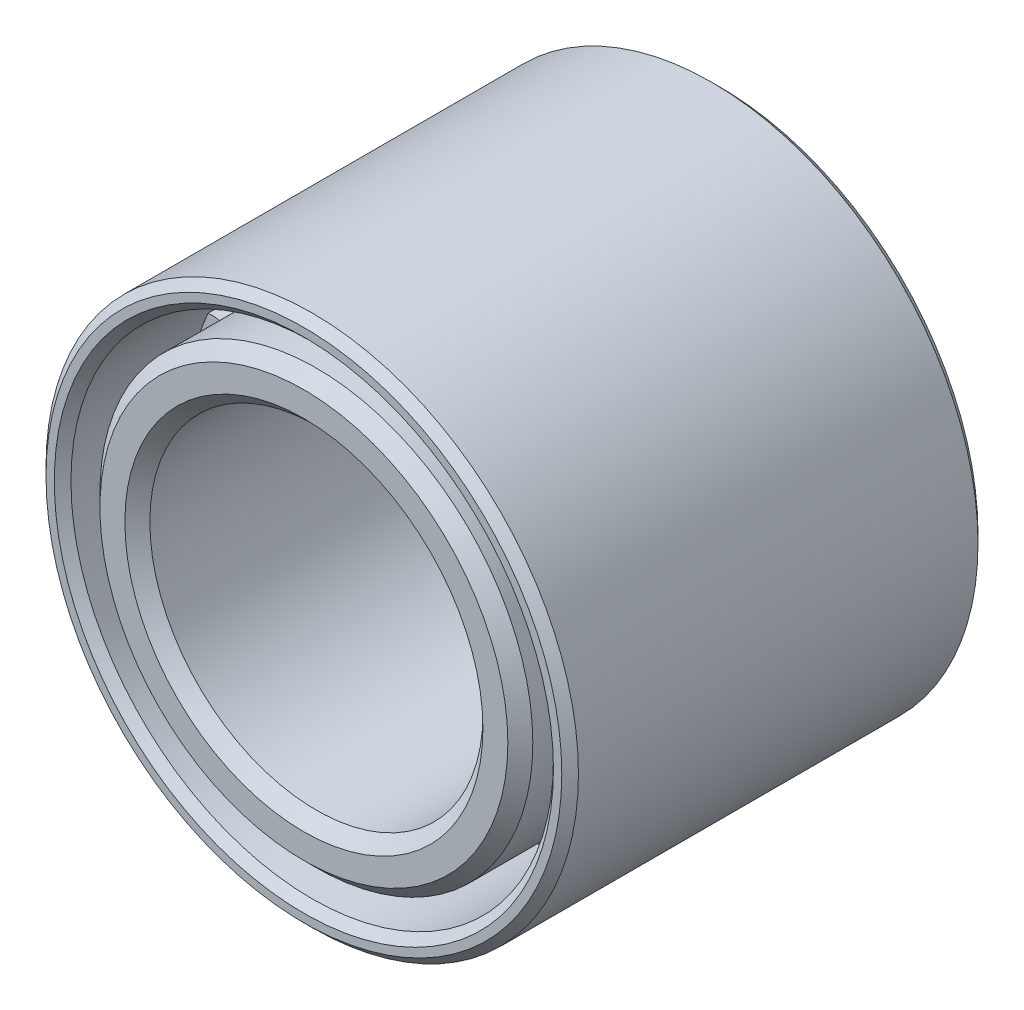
ISO-10303-21;
HEADER;
FILE_DESCRIPTION(('STEP AP214'),'2;1');
FILE_NAME('part.step','',(''),(''),'','','');
FILE_SCHEMA(('AUTOMOTIVE_DESIGN { 1 0 10303 214 1 1 1 1 }'));
ENDSEC;
DATA;
#1=APPLICATION_CONTEXT('core data for automotive mechanical design processes');
#2=APPLICATION_PROTOCOL_DEFINITION('international standard','automotive_design',2000,#1);
#3=PRODUCT_CONTEXT('',#1,'mechanical');
#4=PRODUCT('Part','Part','',(#3));
#5=PRODUCT_RELATED_PRODUCT_CATEGORY('part','',(#4));
#6=PRODUCT_DEFINITION_FORMATION('','',#4);
#7=PRODUCT_DEFINITION_CONTEXT('part definition',#1,'design');
#8=PRODUCT_DEFINITION('design','',#6,#7);
#9=PRODUCT_DEFINITION_SHAPE('','',#8);
#10=(LENGTH_UNIT() NAMED_UNIT(*) SI_UNIT(.MILLI.,.METRE.));
#11=(NAMED_UNIT(*) PLANE_ANGLE_UNIT() SI_UNIT($,.RADIAN.));
#12=(NAMED_UNIT(*) SI_UNIT($,.STERADIAN.) SOLID_ANGLE_UNIT());
#13=UNCERTAINTY_MEASURE_WITH_UNIT(LENGTH_MEASURE(1.E-05),#10,'distance_accuracy_value','');
#14=(GEOMETRIC_REPRESENTATION_CONTEXT(3) GLOBAL_UNCERTAINTY_ASSIGNED_CONTEXT((#13)) GLOBAL_UNIT_ASSIGNED_CONTEXT((#10,
#11,#12)) REPRESENTATION_CONTEXT('',''));
#15=CARTESIAN_POINT('',(0.,0.,0.));
#16=DIRECTION('',(0.,0.,1.));
#17=DIRECTION('',(1.,0.,0.));
#18=AXIS2_PLACEMENT_3D('',#15,#16,#17);
#19=CARTESIAN_POINT('',(0.,0.,25.4));
#20=DIRECTION('',(0.,0.,-1.));
#21=DIRECTION('',(-1.,0.,0.));
#22=AXIS2_PLACEMENT_3D('',#19,#20,#21);
#23=CYLINDRICAL_SURFACE('',#22,13.208);
#24=CARTESIAN_POINT('',(0.,0.,17.78));
#25=DIRECTION('',(0.,0.,-1.));
#26=DIRECTION('',(-1.,0.,0.));
#27=AXIS2_PLACEMENT_3D('',#24,#25,#26);
#28=CIRCLE('',#27,13.208);
#29=CARTESIAN_POINT('',(12.0269794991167,5.45921497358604,17.78));
#30=VERTEX_POINT('',#29);
#31=CARTESIAN_POINT('',(12.9388768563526,2.65268348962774,17.78));
#32=VERTEX_POINT('',#31);
#33=EDGE_CURVE('E315',#30,#32,#28,.T.);
#34=ORIENTED_EDGE('',*,*,#33,.F.);
#35=DIRECTION('',(0.,0.,-1.));
#36=VECTOR('',#35,1.);
#37=CARTESIAN_POINT('',(12.0269794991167,5.45921497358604,10.16));
#38=LINE('',#37,#36);
#39=CARTESIAN_POINT('',(12.0269794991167,5.45921497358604,2.54));
#40=VERTEX_POINT('',#39);
#41=EDGE_CURVE('E317',#30,#40,#38,.T.);
#42=ORIENTED_EDGE('',*,*,#41,.T.);
#43=CARTESIAN_POINT('',(0.,0.,2.54));
#44=DIRECTION('',(0.,0.,-1.));
#45=DIRECTION('',(-1.,0.,0.));
#46=AXIS2_PLACEMENT_3D('',#43,#44,#45);
#47=CIRCLE('',#46,13.208);
#48=CARTESIAN_POINT('',(12.9388768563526,2.65268348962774,2.54));
#49=VERTEX_POINT('',#48);
#50=EDGE_CURVE('E312',#40,#49,#47,.T.);
#51=ORIENTED_EDGE('',*,*,#50,.T.);
#52=DIRECTION('',(0.,0.,-1.));
#53=VECTOR('',#52,1.);
#54=CARTESIAN_POINT('',(12.9388768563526,2.65268348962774,10.16));
#55=LINE('',#54,#53);
#56=EDGE_CURVE('E320',#49,#32,#55,.F.);
#57=ORIENTED_EDGE('',*,*,#56,.T.);
#58=EDGE_LOOP('',(#34,#42,#51,#57));
#59=FACE_BOUND('',#58,.T.);
#60=CARTESIAN_POINT('',(0.,0.,17.78));
#61=DIRECTION('',(0.,0.,-1.));
#62=DIRECTION('',(-1.,0.,0.));
#63=AXIS2_PLACEMENT_3D('',#60,#61,#62);
#64=CIRCLE('',#63,13.208);
#65=CARTESIAN_POINT('',(8.90856303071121,-9.75134702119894,17.78));
#66=VERTEX_POINT('',#65);
#67=CARTESIAN_POINT('',(6.52118475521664,-11.4858788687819,17.78));
#68=VERTEX_POINT('',#67);
#69=EDGE_CURVE('E351',#66,#68,#64,.T.);
#70=ORIENTED_EDGE('',*,*,#69,.F.);
#71=DIRECTION('',(0.,0.,-1.));
#72=VECTOR('',#71,1.);
#73=CARTESIAN_POINT('',(8.90856303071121,-9.75134702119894,10.16));
#74=LINE('',#73,#72);
#75=CARTESIAN_POINT('',(8.90856303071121,-9.75134702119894,2.54));
#76=VERTEX_POINT('',#75);
#77=EDGE_CURVE('E353',#66,#76,#74,.T.);
#78=ORIENTED_EDGE('',*,*,#77,.T.);
#79=CARTESIAN_POINT('',(0.,0.,2.54));
#80=DIRECTION('',(0.,0.,-1.));
#81=DIRECTION('',(-1.,0.,0.));
#82=AXIS2_PLACEMENT_3D('',#79,#80,#81);
#83=CIRCLE('',#82,13.208);
#84=CARTESIAN_POINT('',(6.52118475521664,-11.4858788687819,2.54));
#85=VERTEX_POINT('',#84);
#86=EDGE_CURVE('E348',#76,#85,#83,.T.);
#87=ORIENTED_EDGE('',*,*,#86,.T.);
#88=DIRECTION('',(0.,0.,-1.));
#89=VECTOR('',#88,1.);
#90=CARTESIAN_POINT('',(6.52118475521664,-11.4858788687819,10.16));
#91=LINE('',#90,#89);
#92=EDGE_CURVE('E356',#85,#68,#91,.F.);
#93=ORIENTED_EDGE('',*,*,#92,.T.);
#94=EDGE_LOOP('',(#70,#78,#87,#93));
#95=FACE_BOUND('',#94,.T.);
#96=CARTESIAN_POINT('',(0.,0.,17.78));
#97=DIRECTION('',(0.,0.,-1.));
#98=DIRECTION('',(-1.,0.,0.));
#99=AXIS2_PLACEMENT_3D('',#96,#97,#98);
#100=CIRCLE('',#99,13.208);
#101=CARTESIAN_POINT('',(-6.52118475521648,-11.485878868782,17.78));
#102=VERTEX_POINT('',#101);
#103=CARTESIAN_POINT('',(-8.90856303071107,-9.75134702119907,17.78));
#104=VERTEX_POINT('',#103);
#105=EDGE_CURVE('E387',#102,#104,#100,.T.);
#106=ORIENTED_EDGE('',*,*,#105,.F.);
#107=DIRECTION('',(0.,0.,-1.));
#108=VECTOR('',#107,1.);
#109=CARTESIAN_POINT('',(-6.52118475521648,-11.485878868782,10.16));
#110=LINE('',#109,#108);
#111=CARTESIAN_POINT('',(-6.52118475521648,-11.485878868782,2.54));
#112=VERTEX_POINT('',#111);
#113=EDGE_CURVE('E389',#102,#112,#110,.T.);
#114=ORIENTED_EDGE('',*,*,#113,.T.);
#115=CARTESIAN_POINT('',(0.,0.,2.54));
#116=DIRECTION('',(0.,0.,-1.));
#117=DIRECTION('',(-1.,0.,0.));
#118=AXIS2_PLACEMENT_3D('',#115,#116,#117);
#119=CIRCLE('',#118,13.208);
#120=CARTESIAN_POINT('',(-8.90856303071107,-9.75134702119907,2.54));
#121=VERTEX_POINT('',#120);
#122=EDGE_CURVE('E384',#112,#121,#119,.T.);
#123=ORIENTED_EDGE('',*,*,#122,.T.);
#124=DIRECTION('',(0.,0.,-1.));
#125=VECTOR('',#124,1.);
#126=CARTESIAN_POINT('',(-8.90856303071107,-9.75134702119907,10.16));
#127=LINE('',#126,#125);
#128=EDGE_CURVE('E392',#121,#104,#127,.F.);
#129=ORIENTED_EDGE('',*,*,#128,.T.);
#130=EDGE_LOOP('',(#106,#114,#123,#129));
#131=FACE_BOUND('',#130,.T.);
#132=CARTESIAN_POINT('',(0.,0.,17.78));
#133=DIRECTION('',(0.,0.,-1.));
#134=DIRECTION('',(-1.,0.,0.));
#135=AXIS2_PLACEMENT_3D('',#132,#133,#134);
#136=CIRCLE('',#135,13.208);
#137=CARTESIAN_POINT('',(-12.9388768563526,2.65268348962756,17.78));
#138=VERTEX_POINT('',#137);
#139=CARTESIAN_POINT('',(-12.0269794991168,5.45921497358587,17.78));
#140=VERTEX_POINT('',#139);
#141=EDGE_CURVE('E423',#138,#140,#136,.T.);
#142=ORIENTED_EDGE('',*,*,#141,.F.);
#143=DIRECTION('',(0.,0.,-1.));
#144=VECTOR('',#143,1.);
#145=CARTESIAN_POINT('',(-12.9388768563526,2.65268348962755,10.16));
#146=LINE('',#145,#144);
#147=CARTESIAN_POINT('',(-12.9388768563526,2.65268348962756,2.54));
#148=VERTEX_POINT('',#147);
#149=EDGE_CURVE('E425',#138,#148,#146,.T.);
#150=ORIENTED_EDGE('',*,*,#149,.T.);
#151=CARTESIAN_POINT('',(0.,0.,2.54));
#152=DIRECTION('',(0.,0.,-1.));
#153=DIRECTION('',(-1.,0.,0.));
#154=AXIS2_PLACEMENT_3D('',#151,#152,#153);
#155=CIRCLE('',#154,13.208);
#156=CARTESIAN_POINT('',(-12.0269794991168,5.45921497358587,2.54));
#157=VERTEX_POINT('',#156);
#158=EDGE_CURVE('E420',#148,#157,#155,.T.);
#159=ORIENTED_EDGE('',*,*,#158,.T.);
#160=DIRECTION('',(0.,0.,-1.));
#161=VECTOR('',#160,1.);
#162=CARTESIAN_POINT('',(-12.0269794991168,5.45921497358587,10.16));
#163=LINE('',#162,#161);
#164=EDGE_CURVE('E428',#157,#140,#163,.F.);
#165=ORIENTED_EDGE('',*,*,#164,.T.);
#166=EDGE_LOOP('',(#142,#150,#159,#165));
#167=FACE_BOUND('',#166,.T.);
#168=CARTESIAN_POINT('',(0.,0.,17.78));
#169=DIRECTION('',(0.,0.,-1.));
#170=DIRECTION('',(-1.,0.,0.));
#171=AXIS2_PLACEMENT_3D('',#168,#169,#170);
#172=CIRCLE('',#171,13.208);
#173=CARTESIAN_POINT('',(-1.47548091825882,13.1253274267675,17.78));
#174=VERTEX_POINT('',#173);
#175=CARTESIAN_POINT('',(1.47548091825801,13.1253274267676,17.78));
#176=VERTEX_POINT('',#175);
#177=EDGE_CURVE('E522',#174,#176,#172,.T.);
#178=ORIENTED_EDGE('',*,*,#177,.F.);
#179=DIRECTION('',(0.,0.,-1.));
#180=VECTOR('',#179,1.);
#181=CARTESIAN_POINT('',(-1.47548091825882,13.1253274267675,10.16));
#182=LINE('',#181,#180);
#183=CARTESIAN_POINT('',(-1.47548091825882,13.1253274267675,2.54));
#184=VERTEX_POINT('',#183);
#185=EDGE_CURVE('E516',#174,#184,#182,.T.);
#186=ORIENTED_EDGE('',*,*,#185,.T.);
#187=CARTESIAN_POINT('',(0.,0.,2.54));
#188=DIRECTION('',(0.,0.,-1.));
#189=DIRECTION('',(-1.,0.,0.));
#190=AXIS2_PLACEMENT_3D('',#187,#188,#189);
#191=CIRCLE('',#190,13.208);
#192=CARTESIAN_POINT('',(1.47548091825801,13.1253274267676,2.54));
#193=VERTEX_POINT('',#192);
#194=EDGE_CURVE('E513',#184,#193,#191,.T.);
#195=ORIENTED_EDGE('',*,*,#194,.T.);
#196=DIRECTION('',(0.,0.,-1.));
#197=VECTOR('',#196,1.);
#198=CARTESIAN_POINT('',(1.47548091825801,13.1253274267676,10.16));
#199=LINE('',#198,#197);
#200=EDGE_CURVE('E519',#193,#176,#199,.F.);
#201=ORIENTED_EDGE('',*,*,#200,.T.);
#202=EDGE_LOOP('',(#178,#186,#195,#201));
#203=FACE_BOUND('',#202,.T.);
#204=CARTESIAN_POINT('',(0.,0.,0.762000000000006));
#205=DIRECTION('',(0.,0.,1.));
#206=DIRECTION('',(1.,0.,0.));
#207=AXIS2_PLACEMENT_3D('',#204,#205,#206);
#208=CIRCLE('',#207,13.208);
#209=CARTESIAN_POINT('',(13.208,0.,0.762000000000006));
#210=VERTEX_POINT('',#209);
#211=EDGE_CURVE('E504',#210,#210,#208,.T.);
#212=ORIENTED_EDGE('',*,*,#211,.T.);
#213=EDGE_LOOP('',(#212));
#214=FACE_BOUND('',#213,.T.);
#215=CARTESIAN_POINT('',(0.,0.,24.638));
#216=DIRECTION('',(0.,0.,1.));
#217=DIRECTION('',(1.,0.,0.));
#218=AXIS2_PLACEMENT_3D('',#215,#216,#217);
#219=CIRCLE('',#218,13.208);
#220=CARTESIAN_POINT('',(13.208,0.,24.638));
#221=VERTEX_POINT('',#220);
#222=EDGE_CURVE('E501',#221,#221,#219,.F.);
#223=ORIENTED_EDGE('',*,*,#222,.T.);
#224=EDGE_LOOP('',(#223));
#225=FACE_BOUND('',#224,.T.);
#226=CARTESIAN_POINT('',(0.,0.,17.78));
#227=DIRECTION('',(0.,0.,-1.));
#228=DIRECTION('',(-1.,0.,0.));
#229=AXIS2_PLACEMENT_3D('',#226,#227,#228);
#230=CIRCLE('',#229,13.208);
#231=CARTESIAN_POINT('',(-8.90856303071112,9.75134702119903,17.78));
#232=VERTEX_POINT('',#231);
#233=CARTESIAN_POINT('',(-6.5211847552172,11.4858788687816,17.78));
#234=VERTEX_POINT('',#233);
#235=EDGE_CURVE('E441',#232,#234,#230,.T.);
#236=ORIENTED_EDGE('',*,*,#235,.F.);
#237=DIRECTION('',(0.,0.,-1.));
#238=VECTOR('',#237,1.);
#239=CARTESIAN_POINT('',(-8.90856303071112,9.75134702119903,10.16));
#240=LINE('',#239,#238);
#241=CARTESIAN_POINT('',(-8.90856303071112,9.75134702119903,2.54));
#242=VERTEX_POINT('',#241);
#243=EDGE_CURVE('E443',#232,#242,#240,.T.);
#244=ORIENTED_EDGE('',*,*,#243,.T.);
#245=CARTESIAN_POINT('',(0.,0.,2.54));
#246=DIRECTION('',(0.,0.,-1.));
#247=DIRECTION('',(-1.,0.,0.));
#248=AXIS2_PLACEMENT_3D('',#245,#246,#247);
#249=CIRCLE('',#248,13.208);
#250=CARTESIAN_POINT('',(-6.5211847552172,11.4858788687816,2.54));
#251=VERTEX_POINT('',#250);
#252=EDGE_CURVE('E438',#242,#251,#249,.T.);
#253=ORIENTED_EDGE('',*,*,#252,.T.);
#254=DIRECTION('',(0.,0.,-1.));
#255=VECTOR('',#254,1.);
#256=CARTESIAN_POINT('',(-6.5211847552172,11.4858788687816,10.16));
#257=LINE('',#256,#255);
#258=EDGE_CURVE('E446',#251,#234,#257,.F.);
#259=ORIENTED_EDGE('',*,*,#258,.T.);
#260=EDGE_LOOP('',(#236,#244,#253,#259));
#261=FACE_BOUND('',#260,.T.);
#262=CARTESIAN_POINT('',(0.,0.,17.78));
#263=DIRECTION('',(0.,0.,-1.));
#264=DIRECTION('',(-1.,0.,0.));
#265=AXIS2_PLACEMENT_3D('',#262,#263,#264);
#266=CIRCLE('',#265,13.208);
#267=CARTESIAN_POINT('',(-12.0269794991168,-5.45921497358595,17.78));
#268=VERTEX_POINT('',#267);
#269=CARTESIAN_POINT('',(-12.9388768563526,-2.65268348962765,17.78));
#270=VERTEX_POINT('',#269);
#271=EDGE_CURVE('E405',#268,#270,#266,.T.);
#272=ORIENTED_EDGE('',*,*,#271,.F.);
#273=DIRECTION('',(0.,0.,-1.));
#274=VECTOR('',#273,1.);
#275=CARTESIAN_POINT('',(-12.0269794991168,-5.45921497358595,10.16));
#276=LINE('',#275,#274);
#277=CARTESIAN_POINT('',(-12.0269794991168,-5.45921497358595,2.54));
#278=VERTEX_POINT('',#277);
#279=EDGE_CURVE('E407',#268,#278,#276,.T.);
#280=ORIENTED_EDGE('',*,*,#279,.T.);
#281=CARTESIAN_POINT('',(0.,0.,2.54));
#282=DIRECTION('',(0.,0.,-1.));
#283=DIRECTION('',(-1.,0.,0.));
#284=AXIS2_PLACEMENT_3D('',#281,#282,#283);
#285=CIRCLE('',#284,13.208);
#286=CARTESIAN_POINT('',(-12.9388768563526,-2.65268348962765,2.54));
#287=VERTEX_POINT('',#286);
#288=EDGE_CURVE('E402',#278,#287,#285,.T.);
#289=ORIENTED_EDGE('',*,*,#288,.T.);
#290=DIRECTION('',(0.,0.,-1.));
#291=VECTOR('',#290,1.);
#292=CARTESIAN_POINT('',(-12.9388768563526,-2.65268348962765,10.16));
#293=LINE('',#292,#291);
#294=EDGE_CURVE('E410',#287,#270,#293,.F.);
#295=ORIENTED_EDGE('',*,*,#294,.T.);
#296=EDGE_LOOP('',(#272,#280,#289,#295));
#297=FACE_BOUND('',#296,.T.);
#298=CARTESIAN_POINT('',(0.,0.,17.78));
#299=DIRECTION('',(0.,0.,-1.));
#300=DIRECTION('',(-1.,0.,0.));
#301=AXIS2_PLACEMENT_3D('',#298,#299,#300);
#302=CIRCLE('',#301,13.208);
#303=CARTESIAN_POINT('',(1.47548091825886,-13.1253274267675,17.78));
#304=VERTEX_POINT('',#303);
#305=CARTESIAN_POINT('',(-1.47548091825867,-13.1253274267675,17.78));
#306=VERTEX_POINT('',#305);
#307=EDGE_CURVE('E369',#304,#306,#302,.T.);
#308=ORIENTED_EDGE('',*,*,#307,.F.);
#309=DIRECTION('',(0.,0.,-1.));
#310=VECTOR('',#309,1.);
#311=CARTESIAN_POINT('',(1.47548091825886,-13.1253274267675,10.16));
#312=LINE('',#311,#310);
#313=CARTESIAN_POINT('',(1.47548091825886,-13.1253274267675,2.54));
#314=VERTEX_POINT('',#313);
#315=EDGE_CURVE('E371',#304,#314,#312,.T.);
#316=ORIENTED_EDGE('',*,*,#315,.T.);
#317=CARTESIAN_POINT('',(0.,0.,2.54));
#318=DIRECTION('',(0.,0.,-1.));
#319=DIRECTION('',(-1.,0.,0.));
#320=AXIS2_PLACEMENT_3D('',#317,#318,#319);
#321=CIRCLE('',#320,13.208);
#322=CARTESIAN_POINT('',(-1.47548091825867,-13.1253274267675,2.54));
#323=VERTEX_POINT('',#322);
#324=EDGE_CURVE('E366',#314,#323,#321,.T.);
#325=ORIENTED_EDGE('',*,*,#324,.T.);
#326=DIRECTION('',(0.,0.,-1.));
#327=VECTOR('',#326,1.);
#328=CARTESIAN_POINT('',(-1.47548091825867,-13.1253274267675,10.16));
#329=LINE('',#328,#327);
#330=EDGE_CURVE('E374',#323,#306,#329,.F.);
#331=ORIENTED_EDGE('',*,*,#330,.T.);
#332=EDGE_LOOP('',(#308,#316,#325,#331));
#333=FACE_BOUND('',#332,.T.);
#334=CARTESIAN_POINT('',(0.,0.,17.78));
#335=DIRECTION('',(0.,0.,-1.));
#336=DIRECTION('',(-1.,0.,0.));
#337=AXIS2_PLACEMENT_3D('',#334,#335,#336);
#338=CIRCLE('',#337,13.208);
#339=CARTESIAN_POINT('',(12.9388768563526,-2.65268348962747,17.78));
#340=VERTEX_POINT('',#339);
#341=CARTESIAN_POINT('',(12.0269794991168,-5.45921497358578,17.78));
#342=VERTEX_POINT('',#341);
#343=EDGE_CURVE('E333',#340,#342,#338,.T.);
#344=ORIENTED_EDGE('',*,*,#343,.F.);
#345=DIRECTION('',(0.,0.,-1.));
#346=VECTOR('',#345,1.);
#347=CARTESIAN_POINT('',(12.9388768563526,-2.65268348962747,10.16));
#348=LINE('',#347,#346);
#349=CARTESIAN_POINT('',(12.9388768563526,-2.65268348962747,2.54));
#350=VERTEX_POINT('',#349);
#351=EDGE_CURVE('E335',#340,#350,#348,.T.);
#352=ORIENTED_EDGE('',*,*,#351,.T.);
#353=CARTESIAN_POINT('',(0.,0.,2.54));
#354=DIRECTION('',(0.,0.,-1.));
#355=DIRECTION('',(-1.,0.,0.));
#356=AXIS2_PLACEMENT_3D('',#353,#354,#355);
#357=CIRCLE('',#356,13.208);
#358=CARTESIAN_POINT('',(12.0269794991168,-5.45921497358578,2.54));
#359=VERTEX_POINT('',#358);
#360=EDGE_CURVE('E330',#350,#359,#357,.T.);
#361=ORIENTED_EDGE('',*,*,#360,.T.);
#362=DIRECTION('',(0.,0.,-1.));
#363=VECTOR('',#362,1.);
#364=CARTESIAN_POINT('',(12.0269794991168,-5.45921497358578,10.16));
#365=LINE('',#364,#363);
#366=EDGE_CURVE('E338',#359,#342,#365,.F.);
#367=ORIENTED_EDGE('',*,*,#366,.T.);
#368=EDGE_LOOP('',(#344,#352,#361,#367));
#369=FACE_BOUND('',#368,.T.);
#370=CARTESIAN_POINT('',(0.,0.,17.78));
#371=DIRECTION('',(0.,0.,-1.));
#372=DIRECTION('',(-1.,0.,0.));
#373=AXIS2_PLACEMENT_3D('',#370,#371,#372);
#374=CIRCLE('',#373,13.208);
#375=CARTESIAN_POINT('',(6.52118475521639,11.485878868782,17.78));
#376=VERTEX_POINT('',#375);
#377=CARTESIAN_POINT('',(8.908563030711,9.75134702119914,17.78));
#378=VERTEX_POINT('',#377);
#379=EDGE_CURVE('E287',#376,#378,#374,.T.);
#380=ORIENTED_EDGE('',*,*,#379,.F.);
#381=DIRECTION('',(0.,0.,-1.));
#382=VECTOR('',#381,1.);
#383=CARTESIAN_POINT('',(6.52118475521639,11.485878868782,10.16));
#384=LINE('',#383,#382);
#385=CARTESIAN_POINT('',(6.52118475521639,11.485878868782,2.54));
#386=VERTEX_POINT('',#385);
#387=EDGE_CURVE('E293',#376,#386,#384,.T.);
#388=ORIENTED_EDGE('',*,*,#387,.T.);
#389=CARTESIAN_POINT('',(0.,0.,2.54));
#390=DIRECTION('',(0.,0.,-1.));
#391=DIRECTION('',(-1.,0.,0.));
#392=AXIS2_PLACEMENT_3D('',#389,#390,#391);
#393=CIRCLE('',#392,13.208);
#394=CARTESIAN_POINT('',(8.908563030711,9.75134702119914,2.54));
#395=VERTEX_POINT('',#394);
#396=EDGE_CURVE('E282',#386,#395,#393,.T.);
#397=ORIENTED_EDGE('',*,*,#396,.T.);
#398=DIRECTION('',(0.,0.,-1.));
#399=VECTOR('',#398,1.);
#400=CARTESIAN_POINT('',(8.908563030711,9.75134702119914,10.16));
#401=LINE('',#400,#399);
#402=EDGE_CURVE('E300',#395,#378,#401,.F.);
#403=ORIENTED_EDGE('',*,*,#402,.T.);
#404=EDGE_LOOP('',(#380,#388,#397,#403));
#405=FACE_BOUND('',#404,.T.);
#406=ADVANCED_FACE('F30',(#59,#95,#131,#167,#203,#214,#225,#261,#297,#333,#369,#405),#23,.T.);
#407=CARTESIAN_POINT('',(0.,0.,0.));
#408=DIRECTION('',(0.,0.,1.));
#409=DIRECTION('',(1.,0.,0.));
#410=AXIS2_PLACEMENT_3D('',#407,#408,#409);
#411=CYLINDRICAL_SURFACE('',#410,14.7223839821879);
#412=CARTESIAN_POINT('',(0.,0.,17.78));
#413=DIRECTION('',(0.,0.,-1.));
#414=DIRECTION('',(-1.,0.,0.));
#415=AXIS2_PLACEMENT_3D('',#412,#413,#414);
#416=CIRCLE('',#415,14.7223839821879);
#417=CARTESIAN_POINT('',(14.389248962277,3.11417796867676,17.78));
#418=VERTEX_POINT('',#417);
#419=CARTESIAN_POINT('',(13.4716148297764,5.93836543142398,17.78));
#420=VERTEX_POINT('',#419);
#421=EDGE_CURVE('E614',#418,#420,#416,.F.);
#422=ORIENTED_EDGE('',*,*,#421,.F.);
#423=DIRECTION('',(0.,0.,-1.));
#424=VECTOR('',#423,1.);
#425=CARTESIAN_POINT('',(14.389248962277,3.11417796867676,10.16));
#426=LINE('',#425,#424);
#427=CARTESIAN_POINT('',(14.389248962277,3.11417796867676,2.54));
#428=VERTEX_POINT('',#427);
#429=EDGE_CURVE('E608',#418,#428,#426,.T.);
#430=ORIENTED_EDGE('',*,*,#429,.T.);
#431=CARTESIAN_POINT('',(0.,0.,2.54));
#432=DIRECTION('',(0.,0.,-1.));
#433=DIRECTION('',(-1.,0.,0.));
#434=AXIS2_PLACEMENT_3D('',#431,#432,#433);
#435=CIRCLE('',#434,14.7223839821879);
#436=CARTESIAN_POINT('',(13.4716148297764,5.93836543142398,2.54));
#437=VERTEX_POINT('',#436);
#438=EDGE_CURVE('E605',#428,#437,#435,.F.);
#439=ORIENTED_EDGE('',*,*,#438,.T.);
#440=DIRECTION('',(0.,0.,-1.));
#441=VECTOR('',#440,1.);
#442=CARTESIAN_POINT('',(13.4716148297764,5.93836543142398,10.16));
#443=LINE('',#442,#441);
#444=EDGE_CURVE('E611',#437,#420,#443,.F.);
#445=ORIENTED_EDGE('',*,*,#444,.T.);
#446=EDGE_LOOP('',(#422,#430,#439,#445));
#447=FACE_BOUND('',#446,.T.);
#448=CARTESIAN_POINT('',(0.,0.,17.78));
#449=DIRECTION('',(0.,0.,-1.));
#450=DIRECTION('',(-1.,0.,0.));
#451=AXIS2_PLACEMENT_3D('',#448,#449,#450);
#452=CIRCLE('',#451,14.7223839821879);
#453=CARTESIAN_POINT('',(7.40828171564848,-12.7226550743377,17.78));
#454=VERTEX_POINT('',#453);
#455=CARTESIAN_POINT('',(9.8106790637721,-10.9772112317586,17.78));
#456=VERTEX_POINT('',#455);
#457=EDGE_CURVE('E592',#454,#456,#452,.F.);
#458=ORIENTED_EDGE('',*,*,#457,.F.);
#459=DIRECTION('',(0.,0.,-1.));
#460=VECTOR('',#459,1.);
#461=CARTESIAN_POINT('',(7.40828171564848,-12.7226550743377,10.16));
#462=LINE('',#461,#460);
#463=CARTESIAN_POINT('',(7.40828171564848,-12.7226550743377,2.54));
#464=VERTEX_POINT('',#463);
#465=EDGE_CURVE('E586',#454,#464,#462,.T.);
#466=ORIENTED_EDGE('',*,*,#465,.T.);
#467=CARTESIAN_POINT('',(0.,0.,2.54));
#468=DIRECTION('',(0.,0.,-1.));
#469=DIRECTION('',(-1.,0.,0.));
#470=AXIS2_PLACEMENT_3D('',#467,#468,#469);
#471=CIRCLE('',#470,14.7223839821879);
#472=CARTESIAN_POINT('',(9.8106790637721,-10.9772112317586,2.54));
#473=VERTEX_POINT('',#472);
#474=EDGE_CURVE('E583',#464,#473,#471,.F.);
#475=ORIENTED_EDGE('',*,*,#474,.T.);
#476=DIRECTION('',(0.,0.,-1.));
#477=VECTOR('',#476,1.);
#478=CARTESIAN_POINT('',(9.8106790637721,-10.9772112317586,10.16));
#479=LINE('',#478,#477);
#480=EDGE_CURVE('E589',#473,#456,#479,.F.);
#481=ORIENTED_EDGE('',*,*,#480,.T.);
#482=EDGE_LOOP('',(#458,#466,#475,#481));
#483=FACE_BOUND('',#482,.T.);
#484=CARTESIAN_POINT('',(0.,0.,17.78));
#485=DIRECTION('',(0.,0.,-1.));
#486=DIRECTION('',(-1.,0.,0.));
#487=AXIS2_PLACEMENT_3D('',#484,#485,#486);
#488=CIRCLE('',#487,14.7223839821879);
#489=CARTESIAN_POINT('',(-9.81067906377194,-10.9772112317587,17.78));
#490=VERTEX_POINT('',#489);
#491=CARTESIAN_POINT('',(-7.4082817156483,-12.7226550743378,17.78));
#492=VERTEX_POINT('',#491);
#493=EDGE_CURVE('E570',#490,#492,#488,.F.);
#494=ORIENTED_EDGE('',*,*,#493,.F.);
#495=DIRECTION('',(0.,0.,-1.));
#496=VECTOR('',#495,1.);
#497=CARTESIAN_POINT('',(-9.81067906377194,-10.9772112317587,10.16));
#498=LINE('',#497,#496);
#499=CARTESIAN_POINT('',(-9.81067906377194,-10.9772112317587,2.54));
#500=VERTEX_POINT('',#499);
#501=EDGE_CURVE('E564',#490,#500,#498,.T.);
#502=ORIENTED_EDGE('',*,*,#501,.T.);
#503=CARTESIAN_POINT('',(0.,0.,2.54));
#504=DIRECTION('',(0.,0.,-1.));
#505=DIRECTION('',(-1.,0.,0.));
#506=AXIS2_PLACEMENT_3D('',#503,#504,#505);
#507=CIRCLE('',#506,14.7223839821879);
#508=CARTESIAN_POINT('',(-7.4082817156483,-12.7226550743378,2.54));
#509=VERTEX_POINT('',#508);
#510=EDGE_CURVE('E561',#500,#509,#507,.F.);
#511=ORIENTED_EDGE('',*,*,#510,.T.);
#512=DIRECTION('',(0.,0.,-1.));
#513=VECTOR('',#512,1.);
#514=CARTESIAN_POINT('',(-7.4082817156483,-12.7226550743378,10.16));
#515=LINE('',#514,#513);
#516=EDGE_CURVE('E567',#509,#492,#515,.F.);
#517=ORIENTED_EDGE('',*,*,#516,.T.);
#518=EDGE_LOOP('',(#494,#502,#511,#517));
#519=FACE_BOUND('',#518,.T.);
#520=CARTESIAN_POINT('',(0.,0.,17.78));
#521=DIRECTION('',(0.,0.,-1.));
#522=DIRECTION('',(-1.,0.,0.));
#523=AXIS2_PLACEMENT_3D('',#520,#521,#522);
#524=CIRCLE('',#523,14.7223839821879);
#525=CARTESIAN_POINT('',(-13.4716148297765,5.93836543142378,17.78));
#526=VERTEX_POINT('',#525);
#527=CARTESIAN_POINT('',(-14.3892489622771,3.11417796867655,17.78));
#528=VERTEX_POINT('',#527);
#529=EDGE_CURVE('E548',#526,#528,#524,.F.);
#530=ORIENTED_EDGE('',*,*,#529,.F.);
#531=DIRECTION('',(0.,0.,-1.));
#532=VECTOR('',#531,1.);
#533=CARTESIAN_POINT('',(-13.4716148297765,5.93836543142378,10.16));
#534=LINE('',#533,#532);
#535=CARTESIAN_POINT('',(-13.4716148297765,5.93836543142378,2.54));
#536=VERTEX_POINT('',#535);
#537=EDGE_CURVE('E542',#526,#536,#534,.T.);
#538=ORIENTED_EDGE('',*,*,#537,.T.);
#539=CARTESIAN_POINT('',(0.,0.,2.54));
#540=DIRECTION('',(0.,0.,-1.));
#541=DIRECTION('',(-1.,0.,0.));
#542=AXIS2_PLACEMENT_3D('',#539,#540,#541);
#543=CIRCLE('',#542,14.7223839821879);
#544=CARTESIAN_POINT('',(-14.3892489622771,3.11417796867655,2.54));
#545=VERTEX_POINT('',#544);
#546=EDGE_CURVE('E539',#536,#545,#543,.F.);
#547=ORIENTED_EDGE('',*,*,#546,.T.);
#548=DIRECTION('',(0.,0.,-1.));
#549=VECTOR('',#548,1.);
#550=CARTESIAN_POINT('',(-14.3892489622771,3.11417796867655,10.16));
#551=LINE('',#550,#549);
#552=EDGE_CURVE('E545',#545,#528,#551,.F.);
#553=ORIENTED_EDGE('',*,*,#552,.T.);
#554=EDGE_LOOP('',(#530,#538,#547,#553));
#555=FACE_BOUND('',#554,.T.);
#556=DIRECTION('',(0.,0.,1.));
#557=VECTOR('',#556,1.);
#558=CARTESIAN_POINT('',(-1.48476321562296,14.647322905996,12.7));
#559=LINE('',#558,#557);
#560=CARTESIAN_POINT('',(-1.48476321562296,14.647322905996,17.78));
#561=VERTEX_POINT('',#560);
#562=CARTESIAN_POINT('',(-1.48476321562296,14.647322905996,2.54));
#563=VERTEX_POINT('',#562);
#564=EDGE_CURVE('E476',#561,#563,#559,.F.);
#565=ORIENTED_EDGE('',*,*,#564,.F.);
#566=CARTESIAN_POINT('',(0.,0.,17.78));
#567=DIRECTION('',(0.,0.,-1.));
#568=DIRECTION('',(-1.,0.,0.));
#569=AXIS2_PLACEMENT_3D('',#566,#567,#568);
#570=CIRCLE('',#569,14.7223839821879);
#571=CARTESIAN_POINT('',(1.48476321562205,14.6473229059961,17.78));
#572=VERTEX_POINT('',#571);
#573=EDGE_CURVE('E479',#561,#572,#570,.T.);
#574=ORIENTED_EDGE('',*,*,#573,.T.);
#575=DIRECTION('',(0.,0.,1.));
#576=VECTOR('',#575,1.);
#577=CARTESIAN_POINT('',(1.48476321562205,14.6473229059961,12.7));
#578=LINE('',#577,#576);
#579=CARTESIAN_POINT('',(1.48476321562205,14.6473229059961,2.54));
#580=VERTEX_POINT('',#579);
#581=EDGE_CURVE('E473',#580,#572,#578,.T.);
#582=ORIENTED_EDGE('',*,*,#581,.F.);
#583=CARTESIAN_POINT('',(0.,0.,2.54));
#584=DIRECTION('',(0.,0.,-1.));
#585=DIRECTION('',(-1.,0.,0.));
#586=AXIS2_PLACEMENT_3D('',#583,#584,#585);
#587=CIRCLE('',#586,14.7223839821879);
#588=EDGE_CURVE('E525',#563,#580,#587,.T.);
#589=ORIENTED_EDGE('',*,*,#588,.F.);
#590=EDGE_LOOP('',(#565,#574,#582,#589));
#591=FACE_BOUND('',#590,.T.);
#592=CARTESIAN_POINT('',(0.,0.,0.508000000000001));
#593=DIRECTION('',(0.,0.,1.));
#594=DIRECTION('',(1.,0.,0.));
#595=AXIS2_PLACEMENT_3D('',#592,#593,#594);
#596=CIRCLE('',#595,14.7223839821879);
#597=CARTESIAN_POINT('',(14.7223839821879,0.,0.508000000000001));
#598=VERTEX_POINT('',#597);
#599=EDGE_CURVE('E470',#598,#598,#596,.F.);
#600=ORIENTED_EDGE('',*,*,#599,.T.);
#601=EDGE_LOOP('',(#600));
#602=FACE_BOUND('',#601,.T.);
#603=CARTESIAN_POINT('',(0.,0.,24.892));
#604=DIRECTION('',(0.,0.,1.));
#605=DIRECTION('',(1.,0.,0.));
#606=AXIS2_PLACEMENT_3D('',#603,#604,#605);
#607=CIRCLE('',#606,14.7223839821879);
#608=CARTESIAN_POINT('',(14.7223839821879,0.,24.892));
#609=VERTEX_POINT('',#608);
#610=EDGE_CURVE('E455',#609,#609,#607,.T.);
#611=ORIENTED_EDGE('',*,*,#610,.T.);
#612=EDGE_LOOP('',(#611));
#613=FACE_BOUND('',#612,.T.);
#614=CARTESIAN_POINT('',(0.,0.,17.78));
#615=DIRECTION('',(0.,0.,-1.));
#616=DIRECTION('',(-1.,0.,0.));
#617=AXIS2_PLACEMENT_3D('',#614,#615,#616);
#618=CIRCLE('',#617,14.7223839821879);
#619=CARTESIAN_POINT('',(-7.4082817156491,12.7226550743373,17.78));
#620=VERTEX_POINT('',#619);
#621=CARTESIAN_POINT('',(-9.81067906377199,10.9772112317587,17.78));
#622=VERTEX_POINT('',#621);
#623=EDGE_CURVE('E537',#620,#622,#618,.F.);
#624=ORIENTED_EDGE('',*,*,#623,.F.);
#625=DIRECTION('',(0.,0.,-1.));
#626=VECTOR('',#625,1.);
#627=CARTESIAN_POINT('',(-7.4082817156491,12.7226550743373,10.16));
#628=LINE('',#627,#626);
#629=CARTESIAN_POINT('',(-7.4082817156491,12.7226550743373,2.54));
#630=VERTEX_POINT('',#629);
#631=EDGE_CURVE('E531',#620,#630,#628,.T.);
#632=ORIENTED_EDGE('',*,*,#631,.T.);
#633=CARTESIAN_POINT('',(0.,0.,2.54));
#634=DIRECTION('',(0.,0.,-1.));
#635=DIRECTION('',(-1.,0.,0.));
#636=AXIS2_PLACEMENT_3D('',#633,#634,#635);
#637=CIRCLE('',#636,14.7223839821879);
#638=CARTESIAN_POINT('',(-9.81067906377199,10.9772112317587,2.54));
#639=VERTEX_POINT('',#638);
#640=EDGE_CURVE('E528',#630,#639,#637,.F.);
#641=ORIENTED_EDGE('',*,*,#640,.T.);
#642=DIRECTION('',(0.,0.,-1.));
#643=VECTOR('',#642,1.);
#644=CARTESIAN_POINT('',(-9.81067906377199,10.9772112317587,10.16));
#645=LINE('',#644,#643);
#646=EDGE_CURVE('E534',#639,#622,#645,.F.);
#647=ORIENTED_EDGE('',*,*,#646,.T.);
#648=EDGE_LOOP('',(#624,#632,#641,#647));
#649=FACE_BOUND('',#648,.T.);
#650=CARTESIAN_POINT('',(0.,0.,17.78));
#651=DIRECTION('',(0.,0.,-1.));
#652=DIRECTION('',(-1.,0.,0.));
#653=AXIS2_PLACEMENT_3D('',#650,#651,#652);
#654=CIRCLE('',#653,14.7223839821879);
#655=CARTESIAN_POINT('',(-14.3892489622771,-3.11417796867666,17.78));
#656=VERTEX_POINT('',#655);
#657=CARTESIAN_POINT('',(-13.4716148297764,-5.93836543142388,17.78));
#658=VERTEX_POINT('',#657);
#659=EDGE_CURVE('E559',#656,#658,#654,.F.);
#660=ORIENTED_EDGE('',*,*,#659,.F.);
#661=DIRECTION('',(0.,0.,-1.));
#662=VECTOR('',#661,1.);
#663=CARTESIAN_POINT('',(-14.3892489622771,-3.11417796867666,10.16));
#664=LINE('',#663,#662);
#665=CARTESIAN_POINT('',(-14.3892489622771,-3.11417796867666,2.54));
#666=VERTEX_POINT('',#665);
#667=EDGE_CURVE('E553',#656,#666,#664,.T.);
#668=ORIENTED_EDGE('',*,*,#667,.T.);
#669=CARTESIAN_POINT('',(0.,0.,2.54));
#670=DIRECTION('',(0.,0.,-1.));
#671=DIRECTION('',(-1.,0.,0.));
#672=AXIS2_PLACEMENT_3D('',#669,#670,#671);
#673=CIRCLE('',#672,14.7223839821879);
#674=CARTESIAN_POINT('',(-13.4716148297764,-5.93836543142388,2.54));
#675=VERTEX_POINT('',#674);
#676=EDGE_CURVE('E550',#666,#675,#673,.F.);
#677=ORIENTED_EDGE('',*,*,#676,.T.);
#678=DIRECTION('',(0.,0.,-1.));
#679=VECTOR('',#678,1.);
#680=CARTESIAN_POINT('',(-13.4716148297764,-5.93836543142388,10.16));
#681=LINE('',#680,#679);
#682=EDGE_CURVE('E556',#675,#658,#681,.F.);
#683=ORIENTED_EDGE('',*,*,#682,.T.);
#684=EDGE_LOOP('',(#660,#668,#677,#683));
#685=FACE_BOUND('',#684,.T.);
#686=CARTESIAN_POINT('',(0.,0.,17.78));
#687=DIRECTION('',(0.,0.,-1.));
#688=DIRECTION('',(-1.,0.,0.));
#689=AXIS2_PLACEMENT_3D('',#686,#687,#688);
#690=CIRCLE('',#689,14.7223839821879);
#691=CARTESIAN_POINT('',(-1.48476321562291,-14.647322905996,17.78));
#692=VERTEX_POINT('',#691);
#693=CARTESIAN_POINT('',(1.48476321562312,-14.647322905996,17.78));
#694=VERTEX_POINT('',#693);
#695=EDGE_CURVE('E581',#692,#694,#690,.F.);
#696=ORIENTED_EDGE('',*,*,#695,.F.);
#697=DIRECTION('',(0.,0.,-1.));
#698=VECTOR('',#697,1.);
#699=CARTESIAN_POINT('',(-1.48476321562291,-14.647322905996,10.16));
#700=LINE('',#699,#698);
#701=CARTESIAN_POINT('',(-1.48476321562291,-14.647322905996,2.54));
#702=VERTEX_POINT('',#701);
#703=EDGE_CURVE('E575',#692,#702,#700,.T.);
#704=ORIENTED_EDGE('',*,*,#703,.T.);
#705=CARTESIAN_POINT('',(0.,0.,2.54));
#706=DIRECTION('',(0.,0.,-1.));
#707=DIRECTION('',(-1.,0.,0.));
#708=AXIS2_PLACEMENT_3D('',#705,#706,#707);
#709=CIRCLE('',#708,14.7223839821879);
#710=CARTESIAN_POINT('',(1.48476321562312,-14.647322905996,2.54));
#711=VERTEX_POINT('',#710);
#712=EDGE_CURVE('E572',#702,#711,#709,.F.);
#713=ORIENTED_EDGE('',*,*,#712,.T.);
#714=DIRECTION('',(0.,0.,-1.));
#715=VECTOR('',#714,1.);
#716=CARTESIAN_POINT('',(1.48476321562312,-14.647322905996,10.16));
#717=LINE('',#716,#715);
#718=EDGE_CURVE('E578',#711,#694,#717,.F.);
#719=ORIENTED_EDGE('',*,*,#718,.T.);
#720=EDGE_LOOP('',(#696,#704,#713,#719));
#721=FACE_BOUND('',#720,.T.);
#722=CARTESIAN_POINT('',(0.,0.,17.78));
#723=DIRECTION('',(0.,0.,-1.));
#724=DIRECTION('',(-1.,0.,0.));
#725=AXIS2_PLACEMENT_3D('',#722,#723,#724);
#726=CIRCLE('',#725,14.7223839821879);
#727=CARTESIAN_POINT('',(13.4716148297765,-5.93836543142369,17.78));
#728=VERTEX_POINT('',#727);
#729=CARTESIAN_POINT('',(14.3892489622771,-3.11417796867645,17.78));
#730=VERTEX_POINT('',#729);
#731=EDGE_CURVE('E603',#728,#730,#726,.F.);
#732=ORIENTED_EDGE('',*,*,#731,.F.);
#733=DIRECTION('',(0.,0.,-1.));
#734=VECTOR('',#733,1.);
#735=CARTESIAN_POINT('',(13.4716148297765,-5.93836543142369,10.16));
#736=LINE('',#735,#734);
#737=CARTESIAN_POINT('',(13.4716148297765,-5.93836543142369,2.54));
#738=VERTEX_POINT('',#737);
#739=EDGE_CURVE('E597',#728,#738,#736,.T.);
#740=ORIENTED_EDGE('',*,*,#739,.T.);
#741=CARTESIAN_POINT('',(0.,0.,2.54));
#742=DIRECTION('',(0.,0.,-1.));
#743=DIRECTION('',(-1.,0.,0.));
#744=AXIS2_PLACEMENT_3D('',#741,#742,#743);
#745=CIRCLE('',#744,14.7223839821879);
#746=CARTESIAN_POINT('',(14.3892489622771,-3.11417796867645,2.54));
#747=VERTEX_POINT('',#746);
#748=EDGE_CURVE('E594',#738,#747,#745,.F.);
#749=ORIENTED_EDGE('',*,*,#748,.T.);
#750=DIRECTION('',(0.,0.,-1.));
#751=VECTOR('',#750,1.);
#752=CARTESIAN_POINT('',(14.3892489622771,-3.11417796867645,10.16));
#753=LINE('',#752,#751);
#754=EDGE_CURVE('E600',#747,#730,#753,.F.);
#755=ORIENTED_EDGE('',*,*,#754,.T.);
#756=EDGE_LOOP('',(#732,#740,#749,#755));
#757=FACE_BOUND('',#756,.T.);
#758=CARTESIAN_POINT('',(0.,0.,17.78));
#759=DIRECTION('',(0.,0.,-1.));
#760=DIRECTION('',(-1.,0.,0.));
#761=AXIS2_PLACEMENT_3D('',#758,#759,#760);
#762=CIRCLE('',#761,14.7223839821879);
#763=CARTESIAN_POINT('',(9.81067906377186,10.9772112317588,17.78));
#764=VERTEX_POINT('',#763);
#765=CARTESIAN_POINT('',(7.4082817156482,12.7226550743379,17.78));
#766=VERTEX_POINT('',#765);
#767=EDGE_CURVE('E11',#764,#766,#762,.F.);
#768=ORIENTED_EDGE('',*,*,#767,.F.);
#769=DIRECTION('',(0.,0.,-1.));
#770=VECTOR('',#769,1.);
#771=CARTESIAN_POINT('',(9.81067906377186,10.9772112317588,10.16));
#772=LINE('',#771,#770);
#773=CARTESIAN_POINT('',(9.81067906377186,10.9772112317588,2.54));
#774=VERTEX_POINT('',#773);
#775=EDGE_CURVE('E618',#764,#774,#772,.T.);
#776=ORIENTED_EDGE('',*,*,#775,.T.);
#777=CARTESIAN_POINT('',(0.,0.,2.54));
#778=DIRECTION('',(0.,0.,-1.));
#779=DIRECTION('',(-1.,0.,0.));
#780=AXIS2_PLACEMENT_3D('',#777,#778,#779);
#781=CIRCLE('',#780,14.7223839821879);
#782=CARTESIAN_POINT('',(7.4082817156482,12.7226550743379,2.54));
#783=VERTEX_POINT('',#782);
#784=EDGE_CURVE('E616',#774,#783,#781,.F.);
#785=ORIENTED_EDGE('',*,*,#784,.T.);
#786=DIRECTION('',(0.,0.,-1.));
#787=VECTOR('',#786,1.);
#788=CARTESIAN_POINT('',(7.4082817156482,12.7226550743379,10.16));
#789=LINE('',#788,#787);
#790=EDGE_CURVE('E37',#783,#766,#789,.F.);
#791=ORIENTED_EDGE('',*,*,#790,.T.);
#792=EDGE_LOOP('',(#768,#776,#785,#791));
#793=FACE_BOUND('',#792,.T.);
#794=ADVANCED_FACE('F622',(#447,#483,#519,#555,#591,#602,#613,#649,#685,#721,#757,#793),#411,.F.);
#795=CARTESIAN_POINT('',(-4.31192750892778E-13,13.8953520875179,17.78));
#796=DIRECTION('',(0.,0.,-1.));
#797=DIRECTION('',(-1.,0.,0.));
#798=AXIS2_PLACEMENT_3D('',#795,#796,#797);
#799=CYLINDRICAL_SURFACE('',#798,1.66432626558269);
#800=CARTESIAN_POINT('',(-4.31192750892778E-13,13.8953520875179,17.78));
#801=DIRECTION('',(0.,0.,-1.));
#802=DIRECTION('',(-1.,0.,0.));
#803=AXIS2_PLACEMENT_3D('',#800,#801,#802);
#804=CIRCLE('',#803,1.66432626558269);
#805=EDGE_CURVE('E486',#174,#561,#804,.T.);
#806=ORIENTED_EDGE('',*,*,#805,.T.);
#807=ORIENTED_EDGE('',*,*,#564,.T.);
#808=CARTESIAN_POINT('',(-4.31192750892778E-13,13.8953520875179,2.54));
#809=DIRECTION('',(0.,0.,-1.));
#810=DIRECTION('',(-1.,0.,0.));
#811=AXIS2_PLACEMENT_3D('',#808,#809,#810);
#812=CIRCLE('',#811,1.66432626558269);
#813=EDGE_CURVE('E482',#184,#563,#812,.T.);
#814=ORIENTED_EDGE('',*,*,#813,.F.);
#815=ORIENTED_EDGE('',*,*,#185,.F.);
#816=EDGE_LOOP('',(#806,#807,#814,#815));
#817=FACE_BOUND('',#816,.T.);
#818=ADVANCED_FACE('F643',(#817),#799,.T.);
#819=EDGE_CURVE('E481',#580,#193,#812,.T.);
#820=ORIENTED_EDGE('',*,*,#819,.F.);
#821=ORIENTED_EDGE('',*,*,#581,.T.);
#822=EDGE_CURVE('E485',#572,#176,#804,.T.);
#823=ORIENTED_EDGE('',*,*,#822,.T.);
#824=ORIENTED_EDGE('',*,*,#200,.F.);
#825=EDGE_LOOP('',(#820,#821,#823,#824));
#826=FACE_BOUND('',#825,.T.);
#827=ADVANCED_FACE('F814',(#826),#799,.T.);
#828=CARTESIAN_POINT('',(-4.31192750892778E-13,13.8953520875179,17.78));
#829=DIRECTION('',(0.,0.,-1.));
#830=DIRECTION('',(-1.,0.,0.));
#831=AXIS2_PLACEMENT_3D('',#828,#829,#830);
#832=PLANE('',#831);
#833=ORIENTED_EDGE('',*,*,#573,.F.);
#834=ORIENTED_EDGE('',*,*,#805,.F.);
#835=ORIENTED_EDGE('',*,*,#177,.T.);
#836=ORIENTED_EDGE('',*,*,#822,.F.);
#837=EDGE_LOOP('',(#833,#834,#835,#836));
#838=FACE_BOUND('',#837,.T.);
#839=ADVANCED_FACE('F810',(#838),#832,.F.);
#840=CARTESIAN_POINT('',(-4.31192750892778E-13,13.8953520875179,2.54));
#841=DIRECTION('',(0.,0.,-1.));
#842=DIRECTION('',(-1.,0.,0.));
#843=AXIS2_PLACEMENT_3D('',#840,#841,#842);
#844=PLANE('',#843);
#845=ORIENTED_EDGE('',*,*,#813,.T.);
#846=ORIENTED_EDGE('',*,*,#588,.T.);
#847=ORIENTED_EDGE('',*,*,#819,.T.);
#848=ORIENTED_EDGE('',*,*,#194,.F.);
#849=EDGE_LOOP('',(#845,#846,#847,#848));
#850=FACE_BOUND('',#849,.T.);
#851=ADVANCED_FACE('F806',(#850),#844,.T.);
#852=CARTESIAN_POINT('',(0.,0.,25.4));
#853=DIRECTION('',(0.,0.,1.));
#854=DIRECTION('',(1.,0.,0.));
#855=AXIS2_PLACEMENT_3D('',#852,#853,#854);
#856=PLANE('',#855);
#857=CARTESIAN_POINT('',(0.,0.,25.4));
#858=DIRECTION('',(0.,0.,1.));
#859=DIRECTION('',(1.,0.,0.));
#860=AXIS2_PLACEMENT_3D('',#857,#858,#859);
#861=CIRCLE('',#860,12.446);
#862=CARTESIAN_POINT('',(12.446,0.,25.4));
#863=VERTEX_POINT('',#862);
#864=EDGE_CURVE('E510',#863,#863,#861,.T.);
#865=ORIENTED_EDGE('',*,*,#864,.T.);
#866=EDGE_LOOP('',(#865));
#867=FACE_BOUND('',#866,.T.);
#868=CARTESIAN_POINT('',(0.,0.,25.4));
#869=DIRECTION('',(0.,0.,1.));
#870=DIRECTION('',(1.,0.,0.));
#871=AXIS2_PLACEMENT_3D('',#868,#869,#870);
#872=CIRCLE('',#871,10.9250283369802);
#873=CARTESIAN_POINT('',(10.9250283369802,0.,25.4));
#874=VERTEX_POINT('',#873);
#875=EDGE_CURVE('E507',#874,#874,#872,.F.);
#876=ORIENTED_EDGE('',*,*,#875,.T.);
#877=EDGE_LOOP('',(#876));
#878=FACE_BOUND('',#877,.T.);
#879=ADVANCED_FACE('F809',(#867,#878),#856,.T.);
#880=CARTESIAN_POINT('',(0.,0.,0.));
#881=DIRECTION('',(0.,0.,1.));
#882=DIRECTION('',(1.,0.,0.));
#883=AXIS2_PLACEMENT_3D('',#880,#881,#882);
#884=PLANE('',#883);
#885=CARTESIAN_POINT('',(0.,0.,0.));
#886=DIRECTION('',(0.,0.,1.));
#887=DIRECTION('',(1.,0.,0.));
#888=AXIS2_PLACEMENT_3D('',#885,#886,#887);
#889=CIRCLE('',#888,10.9250283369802);
#890=CARTESIAN_POINT('',(10.9250283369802,0.,0.));
#891=VERTEX_POINT('',#890);
#892=EDGE_CURVE('E492',#891,#891,#889,.T.);
#893=ORIENTED_EDGE('',*,*,#892,.T.);
#894=EDGE_LOOP('',(#893));
#895=FACE_BOUND('',#894,.T.);
#896=CARTESIAN_POINT('',(0.,0.,0.));
#897=DIRECTION('',(0.,0.,1.));
#898=DIRECTION('',(1.,0.,0.));
#899=AXIS2_PLACEMENT_3D('',#896,#897,#898);
#900=CIRCLE('',#899,12.446);
#901=CARTESIAN_POINT('',(12.446,0.,0.));
#902=VERTEX_POINT('',#901);
#903=EDGE_CURVE('E489',#902,#902,#900,.F.);
#904=ORIENTED_EDGE('',*,*,#903,.T.);
#905=EDGE_LOOP('',(#904));
#906=FACE_BOUND('',#905,.T.);
#907=ADVANCED_FACE('F837',(#895,#906),#884,.F.);
#908=CARTESIAN_POINT('',(0.,0.,25.4));
#909=DIRECTION('',(0.,0.,-1.));
#910=DIRECTION('',(-1.,0.,0.));
#911=AXIS2_PLACEMENT_3D('',#908,#909,#910);
#912=CYLINDRICAL_SURFACE('',#911,10.1630283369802);
#913=CARTESIAN_POINT('',(0.,0.,0.762000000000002));
#914=DIRECTION('',(0.,0.,1.));
#915=DIRECTION('',(1.,0.,0.));
#916=AXIS2_PLACEMENT_3D('',#913,#914,#915);
#917=CIRCLE('',#916,10.1630283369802);
#918=CARTESIAN_POINT('',(10.1630283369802,0.,0.762000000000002));
#919=VERTEX_POINT('',#918);
#920=EDGE_CURVE('E498',#919,#919,#917,.F.);
#921=ORIENTED_EDGE('',*,*,#920,.T.);
#922=EDGE_LOOP('',(#921));
#923=FACE_BOUND('',#922,.T.);
#924=CARTESIAN_POINT('',(0.,0.,24.638));
#925=DIRECTION('',(0.,0.,1.));
#926=DIRECTION('',(1.,0.,0.));
#927=AXIS2_PLACEMENT_3D('',#924,#925,#926);
#928=CIRCLE('',#927,10.1630283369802);
#929=CARTESIAN_POINT('',(10.1630283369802,0.,24.638));
#930=VERTEX_POINT('',#929);
#931=EDGE_CURVE('E495',#930,#930,#928,.T.);
#932=ORIENTED_EDGE('',*,*,#931,.T.);
#933=EDGE_LOOP('',(#932));
#934=FACE_BOUND('',#933,.T.);
#935=ADVANCED_FACE('F833',(#923,#934),#912,.F.);
#936=CARTESIAN_POINT('',(0.,0.,0.));
#937=DIRECTION('',(0.,0.,-1.));
#938=DIRECTION('',(-1.,0.,0.));
#939=AXIS2_PLACEMENT_3D('',#936,#937,#938);
#940=CONICAL_SURFACE('',#939,10.9250283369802,0.785398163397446);
#941=ORIENTED_EDGE('',*,*,#920,.F.);
#942=EDGE_LOOP('',(#941));
#943=FACE_BOUND('',#942,.T.);
#944=ORIENTED_EDGE('',*,*,#892,.F.);
#945=EDGE_LOOP('',(#944));
#946=FACE_BOUND('',#945,.T.);
#947=ADVANCED_FACE('F829',(#943,#946),#940,.F.);
#948=CARTESIAN_POINT('',(0.,0.,0.762000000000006));
#949=DIRECTION('',(0.,0.,1.));
#950=DIRECTION('',(1.,0.,0.));
#951=AXIS2_PLACEMENT_3D('',#948,#949,#950);
#952=CONICAL_SURFACE('',#951,13.208,0.785398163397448);
#953=ORIENTED_EDGE('',*,*,#903,.F.);
#954=EDGE_LOOP('',(#953));
#955=FACE_BOUND('',#954,.T.);
#956=ORIENTED_EDGE('',*,*,#211,.F.);
#957=EDGE_LOOP('',(#956));
#958=FACE_BOUND('',#957,.T.);
#959=ADVANCED_FACE('F825',(#955,#958),#952,.T.);
#960=CARTESIAN_POINT('',(0.,0.,25.4));
#961=DIRECTION('',(0.,0.,-1.));
#962=DIRECTION('',(-1.,0.,0.));
#963=AXIS2_PLACEMENT_3D('',#960,#961,#962);
#964=CONICAL_SURFACE('',#963,12.446,0.785398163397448);
#965=ORIENTED_EDGE('',*,*,#222,.F.);
#966=EDGE_LOOP('',(#965));
#967=FACE_BOUND('',#966,.T.);
#968=ORIENTED_EDGE('',*,*,#864,.F.);
#969=EDGE_LOOP('',(#968));
#970=FACE_BOUND('',#969,.T.);
#971=ADVANCED_FACE('F821',(#967,#970),#964,.T.);
#972=CARTESIAN_POINT('',(0.,0.,24.638));
#973=DIRECTION('',(0.,0.,1.));
#974=DIRECTION('',(1.,0.,0.));
#975=AXIS2_PLACEMENT_3D('',#972,#973,#974);
#976=CONICAL_SURFACE('',#975,10.1630283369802,0.785398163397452);
#977=ORIENTED_EDGE('',*,*,#875,.F.);
#978=EDGE_LOOP('',(#977));
#979=FACE_BOUND('',#978,.T.);
#980=ORIENTED_EDGE('',*,*,#931,.F.);
#981=EDGE_LOOP('',(#980));
#982=FACE_BOUND('',#981,.T.);
#983=ADVANCED_FACE('F804',(#979,#982),#976,.F.);
#984=CARTESIAN_POINT('',(0.,0.,0.));
#985=DIRECTION('',(0.,0.,1.));
#986=DIRECTION('',(1.,0.,0.));
#987=AXIS2_PLACEMENT_3D('',#984,#985,#986);
#988=CYLINDRICAL_SURFACE('',#987,16.24587426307);
#989=CARTESIAN_POINT('',(0.,0.,0.508000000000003));
#990=DIRECTION('',(0.,0.,1.));
#991=DIRECTION('',(1.,0.,0.));
#992=AXIS2_PLACEMENT_3D('',#989,#990,#991);
#993=CIRCLE('',#992,16.24587426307);
#994=CARTESIAN_POINT('',(16.24587426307,0.,0.508000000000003));
#995=VERTEX_POINT('',#994);
#996=EDGE_CURVE('E461',#995,#995,#993,.T.);
#997=ORIENTED_EDGE('',*,*,#996,.T.);
#998=EDGE_LOOP('',(#997));
#999=FACE_BOUND('',#998,.T.);
#1000=CARTESIAN_POINT('',(0.,0.,24.892));
#1001=DIRECTION('',(0.,0.,1.));
#1002=DIRECTION('',(1.,0.,0.));
#1003=AXIS2_PLACEMENT_3D('',#1000,#1001,#1002);
#1004=CIRCLE('',#1003,16.24587426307);
#1005=CARTESIAN_POINT('',(16.24587426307,0.,24.892));
#1006=VERTEX_POINT('',#1005);
#1007=EDGE_CURVE('E452',#1006,#1006,#1004,.F.);
#1008=ORIENTED_EDGE('',*,*,#1007,.T.);
#1009=EDGE_LOOP('',(#1008));
#1010=FACE_BOUND('',#1009,.T.);
#1011=ADVANCED_FACE('F800',(#999,#1010),#988,.T.);
#1012=CARTESIAN_POINT('',(0.,0.,0.));
#1013=DIRECTION('',(0.,0.,1.));
#1014=DIRECTION('',(1.,0.,0.));
#1015=AXIS2_PLACEMENT_3D('',#1012,#1013,#1014);
#1016=PLANE('',#1015);
#1017=CARTESIAN_POINT('',(0.,0.,0.));
#1018=DIRECTION('',(0.,0.,1.));
#1019=DIRECTION('',(1.,0.,0.));
#1020=AXIS2_PLACEMENT_3D('',#1017,#1018,#1019);
#1021=CIRCLE('',#1020,15.2303839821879);
#1022=CARTESIAN_POINT('',(15.2303839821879,0.,0.));
#1023=VERTEX_POINT('',#1022);
#1024=EDGE_CURVE('E467',#1023,#1023,#1021,.T.);
#1025=ORIENTED_EDGE('',*,*,#1024,.T.);
#1026=EDGE_LOOP('',(#1025));
#1027=FACE_BOUND('',#1026,.T.);
#1028=CARTESIAN_POINT('',(0.,0.,0.));
#1029=DIRECTION('',(0.,0.,1.));
#1030=DIRECTION('',(1.,0.,0.));
#1031=AXIS2_PLACEMENT_3D('',#1028,#1029,#1030);
#1032=CIRCLE('',#1031,15.73787426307);
#1033=CARTESIAN_POINT('',(15.73787426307,0.,0.));
#1034=VERTEX_POINT('',#1033);
#1035=EDGE_CURVE('E464',#1034,#1034,#1032,.F.);
#1036=ORIENTED_EDGE('',*,*,#1035,.T.);
#1037=EDGE_LOOP('',(#1036));
#1038=FACE_BOUND('',#1037,.T.);
#1039=ADVANCED_FACE('F796',(#1027,#1038),#1016,.F.);
#1040=CARTESIAN_POINT('',(0.,0.,25.4));
#1041=DIRECTION('',(0.,0.,1.));
#1042=DIRECTION('',(1.,0.,0.));
#1043=AXIS2_PLACEMENT_3D('',#1040,#1041,#1042);
#1044=PLANE('',#1043);
#1045=CARTESIAN_POINT('',(0.,0.,25.4));
#1046=DIRECTION('',(0.,0.,1.));
#1047=DIRECTION('',(1.,0.,0.));
#1048=AXIS2_PLACEMENT_3D('',#1045,#1046,#1047);
#1049=CIRCLE('',#1048,15.2303839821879);
#1050=CARTESIAN_POINT('',(15.2303839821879,0.,25.4));
#1051=VERTEX_POINT('',#1050);
#1052=EDGE_CURVE('E458',#1051,#1051,#1049,.F.);
#1053=ORIENTED_EDGE('',*,*,#1052,.T.);
#1054=EDGE_LOOP('',(#1053));
#1055=FACE_BOUND('',#1054,.T.);
#1056=CARTESIAN_POINT('',(0.,0.,25.4));
#1057=DIRECTION('',(0.,0.,1.));
#1058=DIRECTION('',(1.,0.,0.));
#1059=AXIS2_PLACEMENT_3D('',#1056,#1057,#1058);
#1060=CIRCLE('',#1059,15.73787426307);
#1061=CARTESIAN_POINT('',(15.73787426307,0.,25.4));
#1062=VERTEX_POINT('',#1061);
#1063=EDGE_CURVE('E449',#1062,#1062,#1060,.T.);
#1064=ORIENTED_EDGE('',*,*,#1063,.T.);
#1065=EDGE_LOOP('',(#1064));
#1066=FACE_BOUND('',#1065,.T.);
#1067=ADVANCED_FACE('F791',(#1055,#1066),#1044,.T.);
#1068=CARTESIAN_POINT('',(0.,0.,25.4));
#1069=DIRECTION('',(0.,0.,-1.));
#1070=DIRECTION('',(-1.,0.,0.));
#1071=AXIS2_PLACEMENT_3D('',#1068,#1069,#1070);
#1072=CONICAL_SURFACE('',#1071,15.73787426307,0.785398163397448);
#1073=ORIENTED_EDGE('',*,*,#1007,.F.);
#1074=EDGE_LOOP('',(#1073));
#1075=FACE_BOUND('',#1074,.T.);
#1076=ORIENTED_EDGE('',*,*,#1063,.F.);
#1077=EDGE_LOOP('',(#1076));
#1078=FACE_BOUND('',#1077,.T.);
#1079=ADVANCED_FACE('F788',(#1075,#1078),#1072,.T.);
#1080=CARTESIAN_POINT('',(0.,0.,24.892));
#1081=DIRECTION('',(0.,0.,1.));
#1082=DIRECTION('',(1.,0.,0.));
#1083=AXIS2_PLACEMENT_3D('',#1080,#1081,#1082);
#1084=CONICAL_SURFACE('',#1083,14.7223839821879,0.785398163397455);
#1085=ORIENTED_EDGE('',*,*,#1052,.F.);
#1086=EDGE_LOOP('',(#1085));
#1087=FACE_BOUND('',#1086,.T.);
#1088=ORIENTED_EDGE('',*,*,#610,.F.);
#1089=EDGE_LOOP('',(#1088));
#1090=FACE_BOUND('',#1089,.T.);
#1091=ADVANCED_FACE('F784',(#1087,#1090),#1084,.F.);
#1092=CARTESIAN_POINT('',(0.,0.,0.508000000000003));
#1093=DIRECTION('',(0.,0.,1.));
#1094=DIRECTION('',(1.,0.,0.));
#1095=AXIS2_PLACEMENT_3D('',#1092,#1093,#1094);
#1096=CONICAL_SURFACE('',#1095,16.24587426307,0.78539816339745);
#1097=ORIENTED_EDGE('',*,*,#1035,.F.);
#1098=EDGE_LOOP('',(#1097));
#1099=FACE_BOUND('',#1098,.T.);
#1100=ORIENTED_EDGE('',*,*,#996,.F.);
#1101=EDGE_LOOP('',(#1100));
#1102=FACE_BOUND('',#1101,.T.);
#1103=ADVANCED_FACE('F780',(#1099,#1102),#1096,.T.);
#1104=CARTESIAN_POINT('',(0.,0.,0.));
#1105=DIRECTION('',(0.,0.,-1.));
#1106=DIRECTION('',(-1.,0.,0.));
#1107=AXIS2_PLACEMENT_3D('',#1104,#1105,#1106);
#1108=CONICAL_SURFACE('',#1107,15.2303839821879,0.785398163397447);
#1109=ORIENTED_EDGE('',*,*,#599,.F.);
#1110=EDGE_LOOP('',(#1109));
#1111=FACE_BOUND('',#1110,.T.);
#1112=ORIENTED_EDGE('',*,*,#1024,.F.);
#1113=EDGE_LOOP('',(#1112));
#1114=FACE_BOUND('',#1113,.T.);
#1115=ADVANCED_FACE('F776',(#1111,#1114),#1108,.F.);
#1116=CARTESIAN_POINT('',(-8.16748303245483,11.2415759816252,17.78));
#1117=DIRECTION('',(0.,0.,-1.));
#1118=DIRECTION('',(-1.,0.,0.));
#1119=AXIS2_PLACEMENT_3D('',#1116,#1117,#1118);
#1120=CYLINDRICAL_SURFACE('',#1119,1.66432626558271);
#1121=ORIENTED_EDGE('',*,*,#258,.F.);
#1122=CARTESIAN_POINT('',(-8.16748303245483,11.2415759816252,2.54));
#1123=DIRECTION('',(0.,0.,-1.));
#1124=DIRECTION('',(-1.,0.,0.));
#1125=AXIS2_PLACEMENT_3D('',#1122,#1123,#1124);
#1126=CIRCLE('',#1125,1.66432626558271);
#1127=EDGE_CURVE('E432',#630,#251,#1126,.T.);
#1128=ORIENTED_EDGE('',*,*,#1127,.F.);
#1129=ORIENTED_EDGE('',*,*,#631,.F.);
#1130=CARTESIAN_POINT('',(-8.16748303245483,11.2415759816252,17.78));
#1131=DIRECTION('',(0.,0.,-1.));
#1132=DIRECTION('',(-1.,0.,0.));
#1133=AXIS2_PLACEMENT_3D('',#1130,#1131,#1132);
#1134=CIRCLE('',#1133,1.66432626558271);
#1135=EDGE_CURVE('E435',#620,#234,#1134,.T.);
#1136=ORIENTED_EDGE('',*,*,#1135,.T.);
#1137=EDGE_LOOP('',(#1121,#1128,#1129,#1136));
#1138=FACE_BOUND('',#1137,.T.);
#1139=ADVANCED_FACE('F773',(#1138),#1120,.T.);
#1140=ORIENTED_EDGE('',*,*,#243,.F.);
#1141=EDGE_CURVE('E434',#232,#622,#1134,.T.);
#1142=ORIENTED_EDGE('',*,*,#1141,.T.);
#1143=ORIENTED_EDGE('',*,*,#646,.F.);
#1144=EDGE_CURVE('E431',#242,#639,#1126,.T.);
#1145=ORIENTED_EDGE('',*,*,#1144,.F.);
#1146=EDGE_LOOP('',(#1140,#1142,#1143,#1145));
#1147=FACE_BOUND('',#1146,.T.);
#1148=ADVANCED_FACE('F771',(#1147),#1120,.T.);
#1149=CARTESIAN_POINT('',(-8.16748303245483,11.2415759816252,17.78));
#1150=DIRECTION('',(0.,0.,-1.));
#1151=DIRECTION('',(-1.,0.,0.));
#1152=AXIS2_PLACEMENT_3D('',#1149,#1150,#1151);
#1153=PLANE('',#1152);
#1154=ORIENTED_EDGE('',*,*,#1141,.F.);
#1155=ORIENTED_EDGE('',*,*,#235,.T.);
#1156=ORIENTED_EDGE('',*,*,#1135,.F.);
#1157=ORIENTED_EDGE('',*,*,#623,.T.);
#1158=EDGE_LOOP('',(#1154,#1155,#1156,#1157));
#1159=FACE_BOUND('',#1158,.T.);
#1160=ADVANCED_FACE('F767',(#1159),#1153,.F.);
#1161=CARTESIAN_POINT('',(-8.16748303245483,11.2415759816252,2.54));
#1162=DIRECTION('',(0.,0.,-1.));
#1163=DIRECTION('',(-1.,0.,0.));
#1164=AXIS2_PLACEMENT_3D('',#1161,#1162,#1163);
#1165=PLANE('',#1164);
#1166=ORIENTED_EDGE('',*,*,#252,.F.);
#1167=ORIENTED_EDGE('',*,*,#1144,.T.);
#1168=ORIENTED_EDGE('',*,*,#640,.F.);
#1169=ORIENTED_EDGE('',*,*,#1127,.T.);
#1170=EDGE_LOOP('',(#1166,#1167,#1168,#1169));
#1171=FACE_BOUND('',#1170,.T.);
#1172=ADVANCED_FACE('F763',(#1171),#1165,.T.);
#1173=CARTESIAN_POINT('',(-13.2152651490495,4.29389993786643,17.78));
#1174=DIRECTION('',(0.,0.,-1.));
#1175=DIRECTION('',(-1.,0.,0.));
#1176=AXIS2_PLACEMENT_3D('',#1173,#1174,#1175);
#1177=CYLINDRICAL_SURFACE('',#1176,1.66432626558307);
#1178=ORIENTED_EDGE('',*,*,#164,.F.);
#1179=CARTESIAN_POINT('',(-13.2152651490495,4.29389993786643,2.54));
#1180=DIRECTION('',(0.,0.,-1.));
#1181=DIRECTION('',(-1.,0.,0.));
#1182=AXIS2_PLACEMENT_3D('',#1179,#1180,#1181);
#1183=CIRCLE('',#1182,1.66432626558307);
#1184=EDGE_CURVE('E414',#536,#157,#1183,.T.);
#1185=ORIENTED_EDGE('',*,*,#1184,.F.);
#1186=ORIENTED_EDGE('',*,*,#537,.F.);
#1187=CARTESIAN_POINT('',(-13.2152651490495,4.29389993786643,17.78));
#1188=DIRECTION('',(0.,0.,-1.));
#1189=DIRECTION('',(-1.,0.,0.));
#1190=AXIS2_PLACEMENT_3D('',#1187,#1188,#1189);
#1191=CIRCLE('',#1190,1.66432626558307);
#1192=EDGE_CURVE('E417',#526,#140,#1191,.T.);
#1193=ORIENTED_EDGE('',*,*,#1192,.T.);
#1194=EDGE_LOOP('',(#1178,#1185,#1186,#1193));
#1195=FACE_BOUND('',#1194,.T.);
#1196=ADVANCED_FACE('F760',(#1195),#1177,.T.);
#1197=ORIENTED_EDGE('',*,*,#149,.F.);
#1198=EDGE_CURVE('E416',#138,#528,#1191,.T.);
#1199=ORIENTED_EDGE('',*,*,#1198,.T.);
#1200=ORIENTED_EDGE('',*,*,#552,.F.);
#1201=EDGE_CURVE('E413',#148,#545,#1183,.T.);
#1202=ORIENTED_EDGE('',*,*,#1201,.F.);
#1203=EDGE_LOOP('',(#1197,#1199,#1200,#1202));
#1204=FACE_BOUND('',#1203,.T.);
#1205=ADVANCED_FACE('F758',(#1204),#1177,.T.);
#1206=CARTESIAN_POINT('',(-13.2152651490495,4.29389993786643,17.78));
#1207=DIRECTION('',(0.,0.,-1.));
#1208=DIRECTION('',(-1.,0.,0.));
#1209=AXIS2_PLACEMENT_3D('',#1206,#1207,#1208);
#1210=PLANE('',#1209);
#1211=ORIENTED_EDGE('',*,*,#1198,.F.);
#1212=ORIENTED_EDGE('',*,*,#141,.T.);
#1213=ORIENTED_EDGE('',*,*,#1192,.F.);
#1214=ORIENTED_EDGE('',*,*,#529,.T.);
#1215=EDGE_LOOP('',(#1211,#1212,#1213,#1214));
#1216=FACE_BOUND('',#1215,.T.);
#1217=ADVANCED_FACE('F754',(#1216),#1210,.F.);
#1218=CARTESIAN_POINT('',(-13.2152651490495,4.29389993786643,2.54));
#1219=DIRECTION('',(0.,0.,-1.));
#1220=DIRECTION('',(-1.,0.,0.));
#1221=AXIS2_PLACEMENT_3D('',#1218,#1219,#1220);
#1222=PLANE('',#1221);
#1223=ORIENTED_EDGE('',*,*,#158,.F.);
#1224=ORIENTED_EDGE('',*,*,#1201,.T.);
#1225=ORIENTED_EDGE('',*,*,#546,.F.);
#1226=ORIENTED_EDGE('',*,*,#1184,.T.);
#1227=EDGE_LOOP('',(#1223,#1224,#1225,#1226));
#1228=FACE_BOUND('',#1227,.T.);
#1229=ADVANCED_FACE('F750',(#1228),#1222,.T.);
#1230=CARTESIAN_POINT('',(-13.2152651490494,-4.29389993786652,17.78));
#1231=DIRECTION('',(0.,0.,-1.));
#1232=DIRECTION('',(-1.,0.,0.));
#1233=AXIS2_PLACEMENT_3D('',#1230,#1231,#1232);
#1234=CYLINDRICAL_SURFACE('',#1233,1.66432626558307);
#1235=ORIENTED_EDGE('',*,*,#294,.F.);
#1236=CARTESIAN_POINT('',(-13.2152651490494,-4.29389993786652,2.54));
#1237=DIRECTION('',(0.,0.,-1.));
#1238=DIRECTION('',(-1.,0.,0.));
#1239=AXIS2_PLACEMENT_3D('',#1236,#1237,#1238);
#1240=CIRCLE('',#1239,1.66432626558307);
#1241=EDGE_CURVE('E396',#666,#287,#1240,.T.);
#1242=ORIENTED_EDGE('',*,*,#1241,.F.);
#1243=ORIENTED_EDGE('',*,*,#667,.F.);
#1244=CARTESIAN_POINT('',(-13.2152651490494,-4.29389993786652,17.78));
#1245=DIRECTION('',(0.,0.,-1.));
#1246=DIRECTION('',(-1.,0.,0.));
#1247=AXIS2_PLACEMENT_3D('',#1244,#1245,#1246);
#1248=CIRCLE('',#1247,1.66432626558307);
#1249=EDGE_CURVE('E399',#656,#270,#1248,.T.);
#1250=ORIENTED_EDGE('',*,*,#1249,.T.);
#1251=EDGE_LOOP('',(#1235,#1242,#1243,#1250));
#1252=FACE_BOUND('',#1251,.T.);
#1253=ADVANCED_FACE('F747',(#1252),#1234,.T.);
#1254=ORIENTED_EDGE('',*,*,#279,.F.);
#1255=EDGE_CURVE('E398',#268,#658,#1248,.T.);
#1256=ORIENTED_EDGE('',*,*,#1255,.T.);
#1257=ORIENTED_EDGE('',*,*,#682,.F.);
#1258=EDGE_CURVE('E395',#278,#675,#1240,.T.);
#1259=ORIENTED_EDGE('',*,*,#1258,.F.);
#1260=EDGE_LOOP('',(#1254,#1256,#1257,#1259));
#1261=FACE_BOUND('',#1260,.T.);
#1262=ADVANCED_FACE('F745',(#1261),#1234,.T.);
#1263=CARTESIAN_POINT('',(-13.2152651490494,-4.29389993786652,17.78));
#1264=DIRECTION('',(0.,0.,-1.));
#1265=DIRECTION('',(-1.,0.,0.));
#1266=AXIS2_PLACEMENT_3D('',#1263,#1264,#1265);
#1267=PLANE('',#1266);
#1268=ORIENTED_EDGE('',*,*,#1255,.F.);
#1269=ORIENTED_EDGE('',*,*,#271,.T.);
#1270=ORIENTED_EDGE('',*,*,#1249,.F.);
#1271=ORIENTED_EDGE('',*,*,#659,.T.);
#1272=EDGE_LOOP('',(#1268,#1269,#1270,#1271));
#1273=FACE_BOUND('',#1272,.T.);
#1274=ADVANCED_FACE('F741',(#1273),#1267,.F.);
#1275=CARTESIAN_POINT('',(-13.2152651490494,-4.29389993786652,2.54));
#1276=DIRECTION('',(0.,0.,-1.));
#1277=DIRECTION('',(-1.,0.,0.));
#1278=AXIS2_PLACEMENT_3D('',#1275,#1276,#1277);
#1279=PLANE('',#1278);
#1280=ORIENTED_EDGE('',*,*,#288,.F.);
#1281=ORIENTED_EDGE('',*,*,#1258,.T.);
#1282=ORIENTED_EDGE('',*,*,#676,.F.);
#1283=ORIENTED_EDGE('',*,*,#1241,.T.);
#1284=EDGE_LOOP('',(#1280,#1281,#1282,#1283));
#1285=FACE_BOUND('',#1284,.T.);
#1286=ADVANCED_FACE('F737',(#1285),#1279,.T.);
#1287=CARTESIAN_POINT('',(-8.16748303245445,-11.2415759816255,17.78));
#1288=DIRECTION('',(0.,0.,-1.));
#1289=DIRECTION('',(-1.,0.,0.));
#1290=AXIS2_PLACEMENT_3D('',#1287,#1288,#1289);
#1291=CYLINDRICAL_SURFACE('',#1290,1.66432626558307);
#1292=ORIENTED_EDGE('',*,*,#128,.F.);
#1293=CARTESIAN_POINT('',(-8.16748303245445,-11.2415759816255,2.54));
#1294=DIRECTION('',(0.,0.,-1.));
#1295=DIRECTION('',(-1.,0.,0.));
#1296=AXIS2_PLACEMENT_3D('',#1293,#1294,#1295);
#1297=CIRCLE('',#1296,1.66432626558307);
#1298=EDGE_CURVE('E378',#500,#121,#1297,.T.);
#1299=ORIENTED_EDGE('',*,*,#1298,.F.);
#1300=ORIENTED_EDGE('',*,*,#501,.F.);
#1301=CARTESIAN_POINT('',(-8.16748303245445,-11.2415759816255,17.78));
#1302=DIRECTION('',(0.,0.,-1.));
#1303=DIRECTION('',(-1.,0.,0.));
#1304=AXIS2_PLACEMENT_3D('',#1301,#1302,#1303);
#1305=CIRCLE('',#1304,1.66432626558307);
#1306=EDGE_CURVE('E381',#490,#104,#1305,.T.);
#1307=ORIENTED_EDGE('',*,*,#1306,.T.);
#1308=EDGE_LOOP('',(#1292,#1299,#1300,#1307));
#1309=FACE_BOUND('',#1308,.T.);
#1310=ADVANCED_FACE('F734',(#1309),#1291,.T.);
#1311=ORIENTED_EDGE('',*,*,#113,.F.);
#1312=EDGE_CURVE('E380',#102,#492,#1305,.T.);
#1313=ORIENTED_EDGE('',*,*,#1312,.T.);
#1314=ORIENTED_EDGE('',*,*,#516,.F.);
#1315=EDGE_CURVE('E377',#112,#509,#1297,.T.);
#1316=ORIENTED_EDGE('',*,*,#1315,.F.);
#1317=EDGE_LOOP('',(#1311,#1313,#1314,#1316));
#1318=FACE_BOUND('',#1317,.T.);
#1319=ADVANCED_FACE('F732',(#1318),#1291,.T.);
#1320=CARTESIAN_POINT('',(-8.16748303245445,-11.2415759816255,17.78));
#1321=DIRECTION('',(0.,0.,-1.));
#1322=DIRECTION('',(-1.,0.,0.));
#1323=AXIS2_PLACEMENT_3D('',#1320,#1321,#1322);
#1324=PLANE('',#1323);
#1325=ORIENTED_EDGE('',*,*,#1312,.F.);
#1326=ORIENTED_EDGE('',*,*,#105,.T.);
#1327=ORIENTED_EDGE('',*,*,#1306,.F.);
#1328=ORIENTED_EDGE('',*,*,#493,.T.);
#1329=EDGE_LOOP('',(#1325,#1326,#1327,#1328));
#1330=FACE_BOUND('',#1329,.T.);
#1331=ADVANCED_FACE('F728',(#1330),#1324,.F.);
#1332=CARTESIAN_POINT('',(-8.16748303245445,-11.2415759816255,2.54));
#1333=DIRECTION('',(0.,0.,-1.));
#1334=DIRECTION('',(-1.,0.,0.));
#1335=AXIS2_PLACEMENT_3D('',#1332,#1333,#1334);
#1336=PLANE('',#1335);
#1337=ORIENTED_EDGE('',*,*,#122,.F.);
#1338=ORIENTED_EDGE('',*,*,#1315,.T.);
#1339=ORIENTED_EDGE('',*,*,#510,.F.);
#1340=ORIENTED_EDGE('',*,*,#1298,.T.);
#1341=EDGE_LOOP('',(#1337,#1338,#1339,#1340));
#1342=FACE_BOUND('',#1341,.T.);
#1343=ADVANCED_FACE('F724',(#1342),#1336,.T.);
#1344=CARTESIAN_POINT('',(0.,-13.895352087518,17.78));
#1345=DIRECTION('',(0.,0.,-1.));
#1346=DIRECTION('',(-1.,0.,0.));
#1347=AXIS2_PLACEMENT_3D('',#1344,#1345,#1346);
#1348=CYLINDRICAL_SURFACE('',#1347,1.66432626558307);
#1349=ORIENTED_EDGE('',*,*,#330,.F.);
#1350=CARTESIAN_POINT('',(0.,-13.895352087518,2.54));
#1351=DIRECTION('',(0.,0.,-1.));
#1352=DIRECTION('',(-1.,0.,0.));
#1353=AXIS2_PLACEMENT_3D('',#1350,#1351,#1352);
#1354=CIRCLE('',#1353,1.66432626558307);
#1355=EDGE_CURVE('E359',#702,#323,#1354,.T.);
#1356=ORIENTED_EDGE('',*,*,#1355,.F.);
#1357=ORIENTED_EDGE('',*,*,#703,.F.);
#1358=CARTESIAN_POINT('',(0.,-13.895352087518,17.78));
#1359=DIRECTION('',(0.,0.,-1.));
#1360=DIRECTION('',(-1.,0.,0.));
#1361=AXIS2_PLACEMENT_3D('',#1358,#1359,#1360);
#1362=CIRCLE('',#1361,1.66432626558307);
#1363=EDGE_CURVE('E362',#692,#306,#1362,.T.);
#1364=ORIENTED_EDGE('',*,*,#1363,.T.);
#1365=EDGE_LOOP('',(#1349,#1356,#1357,#1364));
#1366=FACE_BOUND('',#1365,.T.);
#1367=ADVANCED_FACE('F721',(#1366),#1348,.T.);
#1368=ORIENTED_EDGE('',*,*,#315,.F.);
#1369=EDGE_CURVE('E365',#304,#694,#1362,.T.);
#1370=ORIENTED_EDGE('',*,*,#1369,.T.);
#1371=ORIENTED_EDGE('',*,*,#718,.F.);
#1372=EDGE_CURVE('E361',#314,#711,#1354,.T.);
#1373=ORIENTED_EDGE('',*,*,#1372,.F.);
#1374=EDGE_LOOP('',(#1368,#1370,#1371,#1373));
#1375=FACE_BOUND('',#1374,.T.);
#1376=ADVANCED_FACE('F719',(#1375),#1348,.T.);
#1377=CARTESIAN_POINT('',(0.,-13.895352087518,17.78));
#1378=DIRECTION('',(0.,0.,-1.));
#1379=DIRECTION('',(-1.,0.,0.));
#1380=AXIS2_PLACEMENT_3D('',#1377,#1378,#1379);
#1381=PLANE('',#1380);
#1382=ORIENTED_EDGE('',*,*,#1369,.F.);
#1383=ORIENTED_EDGE('',*,*,#307,.T.);
#1384=ORIENTED_EDGE('',*,*,#1363,.F.);
#1385=ORIENTED_EDGE('',*,*,#695,.T.);
#1386=EDGE_LOOP('',(#1382,#1383,#1384,#1385));
#1387=FACE_BOUND('',#1386,.T.);
#1388=ADVANCED_FACE('F715',(#1387),#1381,.F.);
#1389=CARTESIAN_POINT('',(0.,-13.895352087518,2.54));
#1390=DIRECTION('',(0.,0.,-1.));
#1391=DIRECTION('',(-1.,0.,0.));
#1392=AXIS2_PLACEMENT_3D('',#1389,#1390,#1391);
#1393=PLANE('',#1392);
#1394=ORIENTED_EDGE('',*,*,#324,.F.);
#1395=ORIENTED_EDGE('',*,*,#1372,.T.);
#1396=ORIENTED_EDGE('',*,*,#712,.F.);
#1397=ORIENTED_EDGE('',*,*,#1355,.T.);
#1398=EDGE_LOOP('',(#1394,#1395,#1396,#1397));
#1399=FACE_BOUND('',#1398,.T.);
#1400=ADVANCED_FACE('F711',(#1399),#1393,.T.);
#1401=CARTESIAN_POINT('',(8.16748303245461,-11.2415759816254,17.78));
#1402=DIRECTION('',(0.,0.,-1.));
#1403=DIRECTION('',(-1.,0.,0.));
#1404=AXIS2_PLACEMENT_3D('',#1401,#1402,#1403);
#1405=CYLINDRICAL_SURFACE('',#1404,1.66432626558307);
#1406=ORIENTED_EDGE('',*,*,#92,.F.);
#1407=CARTESIAN_POINT('',(8.16748303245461,-11.2415759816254,2.54));
#1408=DIRECTION('',(0.,0.,-1.));
#1409=DIRECTION('',(-1.,0.,0.));
#1410=AXIS2_PLACEMENT_3D('',#1407,#1408,#1409);
#1411=CIRCLE('',#1410,1.66432626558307);
#1412=EDGE_CURVE('E341',#464,#85,#1411,.T.);
#1413=ORIENTED_EDGE('',*,*,#1412,.F.);
#1414=ORIENTED_EDGE('',*,*,#465,.F.);
#1415=CARTESIAN_POINT('',(8.16748303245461,-11.2415759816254,17.78));
#1416=DIRECTION('',(0.,0.,-1.));
#1417=DIRECTION('',(-1.,0.,0.));
#1418=AXIS2_PLACEMENT_3D('',#1415,#1416,#1417);
#1419=CIRCLE('',#1418,1.66432626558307);
#1420=EDGE_CURVE('E344',#454,#68,#1419,.T.);
#1421=ORIENTED_EDGE('',*,*,#1420,.T.);
#1422=EDGE_LOOP('',(#1406,#1413,#1414,#1421));
#1423=FACE_BOUND('',#1422,.T.);
#1424=ADVANCED_FACE('F708',(#1423),#1405,.T.);
#1425=ORIENTED_EDGE('',*,*,#77,.F.);
#1426=EDGE_CURVE('E345',#66,#456,#1419,.T.);
#1427=ORIENTED_EDGE('',*,*,#1426,.T.);
#1428=ORIENTED_EDGE('',*,*,#480,.F.);
#1429=EDGE_CURVE('E342',#76,#473,#1411,.T.);
#1430=ORIENTED_EDGE('',*,*,#1429,.F.);
#1431=EDGE_LOOP('',(#1425,#1427,#1428,#1430));
#1432=FACE_BOUND('',#1431,.T.);
#1433=ADVANCED_FACE('F706',(#1432),#1405,.T.);
#1434=CARTESIAN_POINT('',(8.16748303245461,-11.2415759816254,17.78));
#1435=DIRECTION('',(0.,0.,-1.));
#1436=DIRECTION('',(-1.,0.,0.));
#1437=AXIS2_PLACEMENT_3D('',#1434,#1435,#1436);
#1438=PLANE('',#1437);
#1439=ORIENTED_EDGE('',*,*,#1426,.F.);
#1440=ORIENTED_EDGE('',*,*,#69,.T.);
#1441=ORIENTED_EDGE('',*,*,#1420,.F.);
#1442=ORIENTED_EDGE('',*,*,#457,.T.);
#1443=EDGE_LOOP('',(#1439,#1440,#1441,#1442));
#1444=FACE_BOUND('',#1443,.T.);
#1445=ADVANCED_FACE('F702',(#1444),#1438,.F.);
#1446=CARTESIAN_POINT('',(8.16748303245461,-11.2415759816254,2.54));
#1447=DIRECTION('',(0.,0.,-1.));
#1448=DIRECTION('',(-1.,0.,0.));
#1449=AXIS2_PLACEMENT_3D('',#1446,#1447,#1448);
#1450=PLANE('',#1449);
#1451=ORIENTED_EDGE('',*,*,#86,.F.);
#1452=ORIENTED_EDGE('',*,*,#1429,.T.);
#1453=ORIENTED_EDGE('',*,*,#474,.F.);
#1454=ORIENTED_EDGE('',*,*,#1412,.T.);
#1455=EDGE_LOOP('',(#1451,#1452,#1453,#1454));
#1456=FACE_BOUND('',#1455,.T.);
#1457=ADVANCED_FACE('F699',(#1456),#1450,.T.);
#1458=CARTESIAN_POINT('',(13.2152651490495,-4.29389993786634,17.78));
#1459=DIRECTION('',(0.,0.,-1.));
#1460=DIRECTION('',(-1.,0.,0.));
#1461=AXIS2_PLACEMENT_3D('',#1458,#1459,#1460);
#1462=CYLINDRICAL_SURFACE('',#1461,1.66432626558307);
#1463=ORIENTED_EDGE('',*,*,#366,.F.);
#1464=CARTESIAN_POINT('',(13.2152651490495,-4.29389993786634,2.54));
#1465=DIRECTION('',(0.,0.,-1.));
#1466=DIRECTION('',(-1.,0.,0.));
#1467=AXIS2_PLACEMENT_3D('',#1464,#1465,#1466);
#1468=CIRCLE('',#1467,1.66432626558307);
#1469=EDGE_CURVE('E323',#738,#359,#1468,.T.);
#1470=ORIENTED_EDGE('',*,*,#1469,.F.);
#1471=ORIENTED_EDGE('',*,*,#739,.F.);
#1472=CARTESIAN_POINT('',(13.2152651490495,-4.29389993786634,17.78));
#1473=DIRECTION('',(0.,0.,-1.));
#1474=DIRECTION('',(-1.,0.,0.));
#1475=AXIS2_PLACEMENT_3D('',#1472,#1473,#1474);
#1476=CIRCLE('',#1475,1.66432626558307);
#1477=EDGE_CURVE('E326',#728,#342,#1476,.T.);
#1478=ORIENTED_EDGE('',*,*,#1477,.T.);
#1479=EDGE_LOOP('',(#1463,#1470,#1471,#1478));
#1480=FACE_BOUND('',#1479,.T.);
#1481=ADVANCED_FACE('F675',(#1480),#1462,.T.);
#1482=ORIENTED_EDGE('',*,*,#351,.F.);
#1483=EDGE_CURVE('E327',#340,#730,#1476,.T.);
#1484=ORIENTED_EDGE('',*,*,#1483,.T.);
#1485=ORIENTED_EDGE('',*,*,#754,.F.);
#1486=EDGE_CURVE('E324',#350,#747,#1468,.T.);
#1487=ORIENTED_EDGE('',*,*,#1486,.F.);
#1488=EDGE_LOOP('',(#1482,#1484,#1485,#1487));
#1489=FACE_BOUND('',#1488,.T.);
#1490=ADVANCED_FACE('F680',(#1489),#1462,.T.);
#1491=CARTESIAN_POINT('',(13.2152651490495,-4.29389993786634,17.78));
#1492=DIRECTION('',(0.,0.,-1.));
#1493=DIRECTION('',(-1.,0.,0.));
#1494=AXIS2_PLACEMENT_3D('',#1491,#1492,#1493);
#1495=PLANE('',#1494);
#1496=ORIENTED_EDGE('',*,*,#1483,.F.);
#1497=ORIENTED_EDGE('',*,*,#343,.T.);
#1498=ORIENTED_EDGE('',*,*,#1477,.F.);
#1499=ORIENTED_EDGE('',*,*,#731,.T.);
#1500=EDGE_LOOP('',(#1496,#1497,#1498,#1499));
#1501=FACE_BOUND('',#1500,.T.);
#1502=ADVANCED_FACE('F672',(#1501),#1495,.F.);
#1503=CARTESIAN_POINT('',(13.2152651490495,-4.29389993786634,2.54));
#1504=DIRECTION('',(0.,0.,-1.));
#1505=DIRECTION('',(-1.,0.,0.));
#1506=AXIS2_PLACEMENT_3D('',#1503,#1504,#1505);
#1507=PLANE('',#1506);
#1508=ORIENTED_EDGE('',*,*,#360,.F.);
#1509=ORIENTED_EDGE('',*,*,#1486,.T.);
#1510=ORIENTED_EDGE('',*,*,#748,.F.);
#1511=ORIENTED_EDGE('',*,*,#1469,.T.);
#1512=EDGE_LOOP('',(#1508,#1509,#1510,#1511));
#1513=FACE_BOUND('',#1512,.T.);
#1514=ADVANCED_FACE('F683',(#1513),#1507,.T.);
#1515=CARTESIAN_POINT('',(13.2152651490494,4.29389993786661,17.78));
#1516=DIRECTION('',(0.,0.,-1.));
#1517=DIRECTION('',(-1.,0.,0.));
#1518=AXIS2_PLACEMENT_3D('',#1515,#1516,#1517);
#1519=CYLINDRICAL_SURFACE('',#1518,1.66432626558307);
#1520=ORIENTED_EDGE('',*,*,#56,.F.);
#1521=CARTESIAN_POINT('',(13.2152651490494,4.29389993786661,2.54));
#1522=DIRECTION('',(0.,0.,-1.));
#1523=DIRECTION('',(-1.,0.,0.));
#1524=AXIS2_PLACEMENT_3D('',#1521,#1522,#1523);
#1525=CIRCLE('',#1524,1.66432626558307);
#1526=EDGE_CURVE('E302',#428,#49,#1525,.T.);
#1527=ORIENTED_EDGE('',*,*,#1526,.F.);
#1528=ORIENTED_EDGE('',*,*,#429,.F.);
#1529=CARTESIAN_POINT('',(13.2152651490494,4.29389993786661,17.78));
#1530=DIRECTION('',(0.,0.,-1.));
#1531=DIRECTION('',(-1.,0.,0.));
#1532=AXIS2_PLACEMENT_3D('',#1529,#1530,#1531);
#1533=CIRCLE('',#1532,1.66432626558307);
#1534=EDGE_CURVE('E308',#418,#32,#1533,.T.);
#1535=ORIENTED_EDGE('',*,*,#1534,.T.);
#1536=EDGE_LOOP('',(#1520,#1527,#1528,#1535));
#1537=FACE_BOUND('',#1536,.T.);
#1538=ADVANCED_FACE('F685',(#1537),#1519,.T.);
#1539=ORIENTED_EDGE('',*,*,#41,.F.);
#1540=EDGE_CURVE('E309',#30,#420,#1533,.T.);
#1541=ORIENTED_EDGE('',*,*,#1540,.T.);
#1542=ORIENTED_EDGE('',*,*,#444,.F.);
#1543=EDGE_CURVE('E306',#40,#437,#1525,.T.);
#1544=ORIENTED_EDGE('',*,*,#1543,.F.);
#1545=EDGE_LOOP('',(#1539,#1541,#1542,#1544));
#1546=FACE_BOUND('',#1545,.T.);
#1547=ADVANCED_FACE('F691',(#1546),#1519,.T.);
#1548=CARTESIAN_POINT('',(13.2152651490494,4.29389993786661,17.78));
#1549=DIRECTION('',(0.,0.,-1.));
#1550=DIRECTION('',(-1.,0.,0.));
#1551=AXIS2_PLACEMENT_3D('',#1548,#1549,#1550);
#1552=PLANE('',#1551);
#1553=ORIENTED_EDGE('',*,*,#1540,.F.);
#1554=ORIENTED_EDGE('',*,*,#33,.T.);
#1555=ORIENTED_EDGE('',*,*,#1534,.F.);
#1556=ORIENTED_EDGE('',*,*,#421,.T.);
#1557=EDGE_LOOP('',(#1553,#1554,#1555,#1556));
#1558=FACE_BOUND('',#1557,.T.);
#1559=ADVANCED_FACE('F1046',(#1558),#1552,.F.);
#1560=CARTESIAN_POINT('',(13.2152651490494,4.29389993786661,2.54));
#1561=DIRECTION('',(0.,0.,-1.));
#1562=DIRECTION('',(-1.,0.,0.));
#1563=AXIS2_PLACEMENT_3D('',#1560,#1561,#1562);
#1564=PLANE('',#1563);
#1565=ORIENTED_EDGE('',*,*,#50,.F.);
#1566=ORIENTED_EDGE('',*,*,#1543,.T.);
#1567=ORIENTED_EDGE('',*,*,#438,.F.);
#1568=ORIENTED_EDGE('',*,*,#1526,.T.);
#1569=EDGE_LOOP('',(#1565,#1566,#1567,#1568));
#1570=FACE_BOUND('',#1569,.T.);
#1571=ADVANCED_FACE('F1055',(#1570),#1564,.T.);
#1572=CARTESIAN_POINT('',(8.16748303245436,11.2415759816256,17.78));
#1573=DIRECTION('',(0.,0.,-1.));
#1574=DIRECTION('',(-1.,0.,0.));
#1575=AXIS2_PLACEMENT_3D('',#1572,#1573,#1574);
#1576=CYLINDRICAL_SURFACE('',#1575,1.66432626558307);
#1577=ORIENTED_EDGE('',*,*,#402,.F.);
#1578=CARTESIAN_POINT('',(8.16748303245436,11.2415759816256,2.54));
#1579=DIRECTION('',(0.,0.,-1.));
#1580=DIRECTION('',(-1.,0.,0.));
#1581=AXIS2_PLACEMENT_3D('',#1578,#1579,#1580);
#1582=CIRCLE('',#1581,1.66432626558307);
#1583=EDGE_CURVE('E44',#774,#395,#1582,.T.);
#1584=ORIENTED_EDGE('',*,*,#1583,.F.);
#1585=ORIENTED_EDGE('',*,*,#775,.F.);
#1586=CARTESIAN_POINT('',(8.16748303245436,11.2415759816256,17.78));
#1587=DIRECTION('',(0.,0.,-1.));
#1588=DIRECTION('',(-1.,0.,0.));
#1589=AXIS2_PLACEMENT_3D('',#1586,#1587,#1588);
#1590=CIRCLE('',#1589,1.66432626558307);
#1591=EDGE_CURVE('E297',#764,#378,#1590,.T.);
#1592=ORIENTED_EDGE('',*,*,#1591,.T.);
#1593=EDGE_LOOP('',(#1577,#1584,#1585,#1592));
#1594=FACE_BOUND('',#1593,.T.);
#1595=ADVANCED_FACE('F624',(#1594),#1576,.T.);
#1596=ORIENTED_EDGE('',*,*,#387,.F.);
#1597=EDGE_CURVE('E288',#376,#766,#1590,.T.);
#1598=ORIENTED_EDGE('',*,*,#1597,.T.);
#1599=ORIENTED_EDGE('',*,*,#790,.F.);
#1600=EDGE_CURVE('E49',#386,#783,#1582,.T.);
#1601=ORIENTED_EDGE('',*,*,#1600,.F.);
#1602=EDGE_LOOP('',(#1596,#1598,#1599,#1601));
#1603=FACE_BOUND('',#1602,.T.);
#1604=ADVANCED_FACE('F291',(#1603),#1576,.T.);
#1605=CARTESIAN_POINT('',(8.16748303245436,11.2415759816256,17.78));
#1606=DIRECTION('',(0.,0.,-1.));
#1607=DIRECTION('',(-1.,0.,0.));
#1608=AXIS2_PLACEMENT_3D('',#1605,#1606,#1607);
#1609=PLANE('',#1608);
#1610=ORIENTED_EDGE('',*,*,#1597,.F.);
#1611=ORIENTED_EDGE('',*,*,#379,.T.);
#1612=ORIENTED_EDGE('',*,*,#1591,.F.);
#1613=ORIENTED_EDGE('',*,*,#767,.T.);
#1614=EDGE_LOOP('',(#1610,#1611,#1612,#1613));
#1615=FACE_BOUND('',#1614,.T.);
#1616=ADVANCED_FACE('F629',(#1615),#1609,.F.);
#1617=CARTESIAN_POINT('',(8.16748303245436,11.2415759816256,2.54));
#1618=DIRECTION('',(0.,0.,-1.));
#1619=DIRECTION('',(-1.,0.,0.));
#1620=AXIS2_PLACEMENT_3D('',#1617,#1618,#1619);
#1621=PLANE('',#1620);
#1622=ORIENTED_EDGE('',*,*,#396,.F.);
#1623=ORIENTED_EDGE('',*,*,#1600,.T.);
#1624=ORIENTED_EDGE('',*,*,#784,.F.);
#1625=ORIENTED_EDGE('',*,*,#1583,.T.);
#1626=EDGE_LOOP('',(#1622,#1623,#1624,#1625));
#1627=FACE_BOUND('',#1626,.T.);
#1628=ADVANCED_FACE('F283',(#1627),#1621,.T.);
#1629=CLOSED_SHELL('',(#406,#794,#818,#827,#839,#851,#879,#907,#935,#947,#959,#971,#983,#1011,
#1039,#1067,#1079,#1091,#1103,#1115,#1139,#1148,#1160,#1172,#1196,#1205,#1217,#1229,#1253,#1262,
#1274,#1286,#1310,#1319,#1331,#1343,#1367,#1376,#1388,#1400,#1424,#1433,#1445,#1457,#1481,#1490,
#1502,#1514,#1538,#1547,#1559,#1571,#1595,#1604,#1616,#1628));
#1630=MANIFOLD_SOLID_BREP('B2',#1629);
#1631=ADVANCED_BREP_SHAPE_REPRESENTATION('',(#18,#1630),#14);
#1632=SHAPE_DEFINITION_REPRESENTATION(#9,#1631);
ENDSEC;
END-ISO-10303-21;
